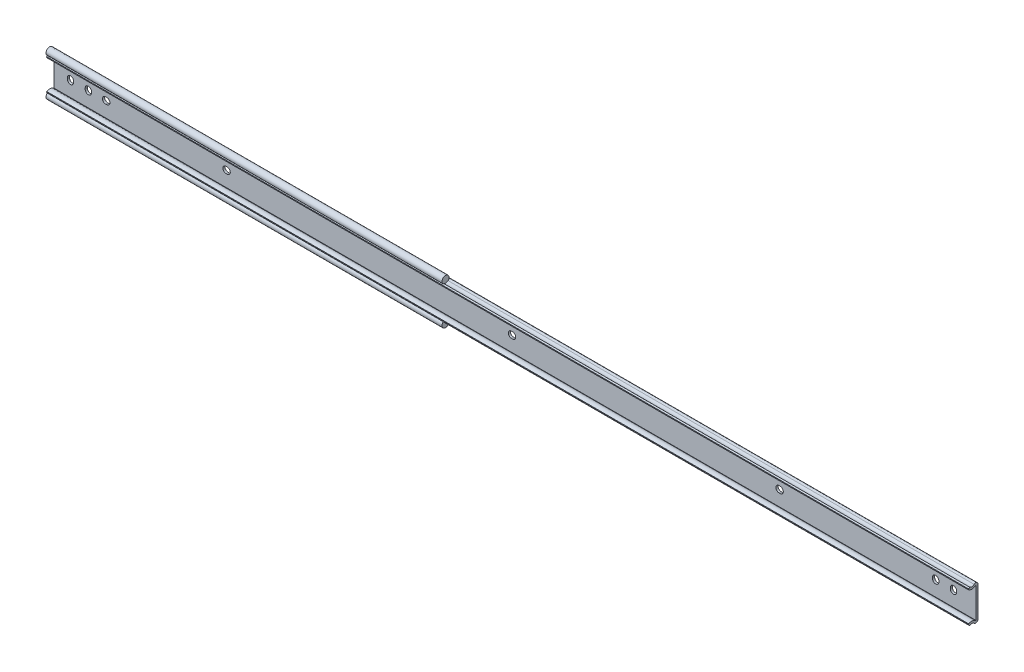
ISO-10303-21;
HEADER;
FILE_DESCRIPTION(('STEP AP214'),'2;1');
FILE_NAME('part.step','',(''),(''),'','','');
FILE_SCHEMA(('AUTOMOTIVE_DESIGN { 1 0 10303 214 1 1 1 1 }'));
ENDSEC;
DATA;
#1=APPLICATION_CONTEXT('core data for automotive mechanical design processes');
#2=APPLICATION_PROTOCOL_DEFINITION('international standard','automotive_design',2000,#1);
#3=PRODUCT_CONTEXT('',#1,'mechanical');
#4=PRODUCT('Part','Part','',(#3));
#5=PRODUCT_RELATED_PRODUCT_CATEGORY('part','',(#4));
#6=PRODUCT_DEFINITION_FORMATION('','',#4);
#7=PRODUCT_DEFINITION_CONTEXT('part definition',#1,'design');
#8=PRODUCT_DEFINITION('design','',#6,#7);
#9=PRODUCT_DEFINITION_SHAPE('','',#8);
#10=(LENGTH_UNIT() NAMED_UNIT(*) SI_UNIT(.MILLI.,.METRE.));
#11=(NAMED_UNIT(*) PLANE_ANGLE_UNIT() SI_UNIT($,.RADIAN.));
#12=(NAMED_UNIT(*) SI_UNIT($,.STERADIAN.) SOLID_ANGLE_UNIT());
#13=UNCERTAINTY_MEASURE_WITH_UNIT(LENGTH_MEASURE(1.E-05),#10,'distance_accuracy_value','');
#14=(GEOMETRIC_REPRESENTATION_CONTEXT(3) GLOBAL_UNCERTAINTY_ASSIGNED_CONTEXT((#13)) GLOBAL_UNIT_ASSIGNED_CONTEXT((#10,
#11,#12)) REPRESENTATION_CONTEXT('',''));
#15=CARTESIAN_POINT('',(0.,0.,0.));
#16=DIRECTION('',(0.,0.,1.));
#17=DIRECTION('',(1.,0.,0.));
#18=AXIS2_PLACEMENT_3D('',#15,#16,#17);
#19=CARTESIAN_POINT('',(-11.9,13.9150000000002,4.44999999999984));
#20=DIRECTION('',(1.,0.,0.));
#21=DIRECTION('',(0.,0.,-1.));
#22=AXIS2_PLACEMENT_3D('',#19,#20,#21);
#23=CYLINDRICAL_SURFACE('',#22,2.55000000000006);
#24=DIRECTION('',(1.,0.,0.));
#25=VECTOR('',#24,1.);
#26=CARTESIAN_POINT('',(-11.9,12.0059666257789,2.75941087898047));
#27=LINE('',#26,#25);
#28=CARTESIAN_POINT('',(270.,12.0059666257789,2.75941087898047));
#29=VERTEX_POINT('',#28);
#30=CARTESIAN_POINT('',(644.5,12.0059666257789,2.75941087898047));
#31=VERTEX_POINT('',#30);
#32=EDGE_CURVE('E604',#29,#31,#27,.T.);
#33=ORIENTED_EDGE('',*,*,#32,.F.);
#34=CARTESIAN_POINT('',(270.,13.9150000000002,4.44999999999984));
#35=DIRECTION('',(-1.,0.,0.));
#36=DIRECTION('',(0.,0.,1.));
#37=AXIS2_PLACEMENT_3D('',#34,#35,#36);
#38=CIRCLE('',#37,2.55000000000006);
#39=CARTESIAN_POINT('',(270.,11.8784795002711,5.98462837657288));
#40=VERTEX_POINT('',#39);
#41=EDGE_CURVE('E357',#29,#40,#38,.T.);
#42=ORIENTED_EDGE('',*,*,#41,.T.);
#43=DIRECTION('',(1.,0.,0.));
#44=VECTOR('',#43,1.);
#45=CARTESIAN_POINT('',(-11.9,11.8784795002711,5.98462837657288));
#46=LINE('',#45,#44);
#47=CARTESIAN_POINT('',(644.5,11.8784795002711,5.98462837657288));
#48=VERTEX_POINT('',#47);
#49=EDGE_CURVE('E603',#40,#48,#46,.T.);
#50=ORIENTED_EDGE('',*,*,#49,.T.);
#51=CARTESIAN_POINT('',(644.5,13.9150000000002,4.44999999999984));
#52=DIRECTION('',(-1.,0.,0.));
#53=DIRECTION('',(0.,0.,1.));
#54=AXIS2_PLACEMENT_3D('',#51,#52,#53);
#55=CIRCLE('',#54,2.55000000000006);
#56=EDGE_CURVE('E531',#31,#48,#55,.T.);
#57=ORIENTED_EDGE('',*,*,#56,.F.);
#58=EDGE_LOOP('',(#33,#42,#50,#57));
#59=FACE_BOUND('',#58,.T.);
#60=ADVANCED_FACE('F14',(#59),#23,.F.);
#61=CARTESIAN_POINT('',(-11.9,-10.7622239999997,0.));
#62=DIRECTION('',(0.,0.,-1.));
#63=DIRECTION('',(-1.,0.,0.));
#64=AXIS2_PLACEMENT_3D('',#61,#62,#63);
#65=PLANE('',#64);
#66=DIRECTION('',(0.,1.,0.));
#67=VECTOR('',#66,1.);
#68=CARTESIAN_POINT('',(-11.9,-10.7622239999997,0.));
#69=LINE('',#68,#67);
#70=CARTESIAN_POINT('',(-11.9,-10.7622239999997,0.));
#71=VERTEX_POINT('',#70);
#72=CARTESIAN_POINT('',(-11.9,10.7622240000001,0.));
#73=VERTEX_POINT('',#72);
#74=EDGE_CURVE('E599',#71,#73,#69,.T.);
#75=ORIENTED_EDGE('',*,*,#74,.T.);
#76=DIRECTION('',(1.,0.,0.));
#77=VECTOR('',#76,1.);
#78=CARTESIAN_POINT('',(-11.9,10.7622240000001,0.));
#79=LINE('',#78,#77);
#80=CARTESIAN_POINT('',(644.5,10.7622240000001,0.));
#81=VERTEX_POINT('',#80);
#82=EDGE_CURVE('E607',#73,#81,#79,.T.);
#83=ORIENTED_EDGE('',*,*,#82,.T.);
#84=DIRECTION('',(0.,1.,0.));
#85=VECTOR('',#84,1.);
#86=CARTESIAN_POINT('',(644.5,-10.7622239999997,0.));
#87=LINE('',#86,#85);
#88=CARTESIAN_POINT('',(644.5,-10.7622239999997,0.));
#89=VERTEX_POINT('',#88);
#90=EDGE_CURVE('E572',#89,#81,#87,.T.);
#91=ORIENTED_EDGE('',*,*,#90,.F.);
#92=DIRECTION('',(1.,0.,0.));
#93=VECTOR('',#92,1.);
#94=CARTESIAN_POINT('',(-11.9,-10.7622239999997,0.));
#95=LINE('',#94,#93);
#96=EDGE_CURVE('E609',#71,#89,#95,.T.);
#97=ORIENTED_EDGE('',*,*,#96,.F.);
#98=EDGE_LOOP('',(#75,#83,#91,#97));
#99=FACE_BOUND('',#98,.T.);
#100=CARTESIAN_POINT('',(504.400000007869,0.00222400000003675,0.));
#101=DIRECTION('',(0.,0.,-1.));
#102=DIRECTION('',(-1.,0.,0.));
#103=AXIS2_PLACEMENT_3D('',#100,#101,#102);
#104=CIRCLE('',#103,2.25);
#105=CARTESIAN_POINT('',(504.400000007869,-2.24777599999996,0.));
#106=VERTEX_POINT('',#105);
#107=CARTESIAN_POINT('',(504.400000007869,2.25222400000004,0.));
#108=VERTEX_POINT('',#107);
#109=EDGE_CURVE('E374',#106,#108,#104,.T.);
#110=ORIENTED_EDGE('',*,*,#109,.F.);
#111=DIRECTION('',(-1.,0.,0.));
#112=VECTOR('',#111,1.);
#113=CARTESIAN_POINT('',(505.200000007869,-2.24777599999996,0.));
#114=LINE('',#113,#112);
#115=CARTESIAN_POINT('',(505.200000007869,-2.24777599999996,0.));
#116=VERTEX_POINT('',#115);
#117=EDGE_CURVE('E382',#116,#106,#114,.T.);
#118=ORIENTED_EDGE('',*,*,#117,.F.);
#119=CARTESIAN_POINT('',(505.200000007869,0.00222400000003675,0.));
#120=DIRECTION('',(0.,0.,-1.));
#121=DIRECTION('',(-1.,0.,0.));
#122=AXIS2_PLACEMENT_3D('',#119,#120,#121);
#123=CIRCLE('',#122,2.25);
#124=CARTESIAN_POINT('',(505.200000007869,2.25222400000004,0.));
#125=VERTEX_POINT('',#124);
#126=EDGE_CURVE('E379',#125,#116,#123,.T.);
#127=ORIENTED_EDGE('',*,*,#126,.F.);
#128=DIRECTION('',(1.,0.,0.));
#129=VECTOR('',#128,1.);
#130=CARTESIAN_POINT('',(504.400000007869,2.25222400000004,0.));
#131=LINE('',#130,#129);
#132=EDGE_CURVE('E376',#108,#125,#131,.T.);
#133=ORIENTED_EDGE('',*,*,#132,.F.);
#134=EDGE_LOOP('',(#110,#118,#127,#133));
#135=FACE_BOUND('',#134,.T.);
#136=CARTESIAN_POINT('',(110.700000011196,0.0034040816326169,0.));
#137=DIRECTION('',(0.,0.,-1.));
#138=DIRECTION('',(-1.,0.,0.));
#139=AXIS2_PLACEMENT_3D('',#136,#137,#138);
#140=CIRCLE('',#139,2.25);
#141=CARTESIAN_POINT('',(110.700000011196,-2.24659591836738,0.));
#142=VERTEX_POINT('',#141);
#143=CARTESIAN_POINT('',(110.700000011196,2.25340408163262,0.));
#144=VERTEX_POINT('',#143);
#145=EDGE_CURVE('E397',#142,#144,#140,.T.);
#146=ORIENTED_EDGE('',*,*,#145,.F.);
#147=DIRECTION('',(-1.,0.,0.));
#148=VECTOR('',#147,1.);
#149=CARTESIAN_POINT('',(111.500000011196,-2.24659591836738,0.));
#150=LINE('',#149,#148);
#151=CARTESIAN_POINT('',(111.500000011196,-2.24659591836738,0.));
#152=VERTEX_POINT('',#151);
#153=EDGE_CURVE('E405',#152,#142,#150,.T.);
#154=ORIENTED_EDGE('',*,*,#153,.F.);
#155=CARTESIAN_POINT('',(111.500000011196,0.0034040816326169,0.));
#156=DIRECTION('',(0.,0.,-1.));
#157=DIRECTION('',(-1.,0.,0.));
#158=AXIS2_PLACEMENT_3D('',#155,#156,#157);
#159=CIRCLE('',#158,2.25);
#160=CARTESIAN_POINT('',(111.500000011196,2.25340408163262,0.));
#161=VERTEX_POINT('',#160);
#162=EDGE_CURVE('E402',#161,#152,#159,.T.);
#163=ORIENTED_EDGE('',*,*,#162,.F.);
#164=DIRECTION('',(1.,0.,0.));
#165=VECTOR('',#164,1.);
#166=CARTESIAN_POINT('',(110.700000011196,2.25340408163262,0.));
#167=LINE('',#166,#165);
#168=EDGE_CURVE('E399',#144,#161,#167,.T.);
#169=ORIENTED_EDGE('',*,*,#168,.F.);
#170=EDGE_LOOP('',(#146,#154,#163,#169));
#171=FACE_BOUND('',#170,.T.);
#172=CARTESIAN_POINT('',(313.900000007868,0.00222400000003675,0.));
#173=DIRECTION('',(0.,0.,-1.));
#174=DIRECTION('',(-1.,0.,0.));
#175=AXIS2_PLACEMENT_3D('',#172,#173,#174);
#176=CIRCLE('',#175,2.25);
#177=CARTESIAN_POINT('',(313.900000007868,-2.24777599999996,0.));
#178=VERTEX_POINT('',#177);
#179=CARTESIAN_POINT('',(313.900000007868,2.25222400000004,0.));
#180=VERTEX_POINT('',#179);
#181=EDGE_CURVE('E411',#178,#180,#176,.T.);
#182=ORIENTED_EDGE('',*,*,#181,.F.);
#183=DIRECTION('',(-1.,0.,0.));
#184=VECTOR('',#183,1.);
#185=CARTESIAN_POINT('',(314.700000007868,-2.24777599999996,0.));
#186=LINE('',#185,#184);
#187=CARTESIAN_POINT('',(314.700000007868,-2.24777599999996,0.));
#188=VERTEX_POINT('',#187);
#189=EDGE_CURVE('E425',#188,#178,#186,.T.);
#190=ORIENTED_EDGE('',*,*,#189,.F.);
#191=CARTESIAN_POINT('',(314.700000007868,0.00222400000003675,0.));
#192=DIRECTION('',(0.,0.,-1.));
#193=DIRECTION('',(-1.,0.,0.));
#194=AXIS2_PLACEMENT_3D('',#191,#192,#193);
#195=CIRCLE('',#194,2.25);
#196=CARTESIAN_POINT('',(314.700000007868,2.25222400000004,0.));
#197=VERTEX_POINT('',#196);
#198=EDGE_CURVE('E422',#197,#188,#195,.T.);
#199=ORIENTED_EDGE('',*,*,#198,.F.);
#200=DIRECTION('',(1.,0.,0.));
#201=VECTOR('',#200,1.);
#202=CARTESIAN_POINT('',(313.900000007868,2.25222400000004,0.));
#203=LINE('',#202,#201);
#204=EDGE_CURVE('E419',#180,#197,#203,.T.);
#205=ORIENTED_EDGE('',*,*,#204,.F.);
#206=EDGE_LOOP('',(#182,#190,#199,#205));
#207=FACE_BOUND('',#206,.T.);
#208=CARTESIAN_POINT('',(25.0000000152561,0.00429010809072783,0.));
#209=DIRECTION('',(0.,0.,-1.));
#210=DIRECTION('',(-1.,0.,0.));
#211=AXIS2_PLACEMENT_3D('',#208,#209,#210);
#212=CIRCLE('',#211,2.25);
#213=CARTESIAN_POINT('',(25.0000000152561,-2.24570989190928,0.));
#214=VERTEX_POINT('',#213);
#215=CARTESIAN_POINT('',(25.0000000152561,2.25429010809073,0.));
#216=VERTEX_POINT('',#215);
#217=EDGE_CURVE('E431',#214,#216,#212,.T.);
#218=ORIENTED_EDGE('',*,*,#217,.F.);
#219=DIRECTION('',(-1.,0.,0.));
#220=VECTOR('',#219,1.);
#221=CARTESIAN_POINT('',(25.800000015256,-2.24570989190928,0.));
#222=LINE('',#221,#220);
#223=CARTESIAN_POINT('',(25.800000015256,-2.24570989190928,0.));
#224=VERTEX_POINT('',#223);
#225=EDGE_CURVE('E445',#224,#214,#222,.T.);
#226=ORIENTED_EDGE('',*,*,#225,.F.);
#227=CARTESIAN_POINT('',(25.800000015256,0.00429010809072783,0.));
#228=DIRECTION('',(0.,0.,-1.));
#229=DIRECTION('',(-1.,0.,0.));
#230=AXIS2_PLACEMENT_3D('',#227,#228,#229);
#231=CIRCLE('',#230,2.25);
#232=CARTESIAN_POINT('',(25.800000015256,2.25429010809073,0.));
#233=VERTEX_POINT('',#232);
#234=EDGE_CURVE('E442',#233,#224,#231,.T.);
#235=ORIENTED_EDGE('',*,*,#234,.F.);
#236=DIRECTION('',(1.,0.,0.));
#237=VECTOR('',#236,1.);
#238=CARTESIAN_POINT('',(25.0000000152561,2.25429010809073,0.));
#239=LINE('',#238,#237);
#240=EDGE_CURVE('E439',#216,#233,#239,.T.);
#241=ORIENTED_EDGE('',*,*,#240,.F.);
#242=EDGE_LOOP('',(#218,#226,#235,#241));
#243=FACE_BOUND('',#242,.T.);
#244=CARTESIAN_POINT('',(0.,-0.400000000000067,0.));
#245=DIRECTION('',(0.,0.,-1.));
#246=DIRECTION('',(1.,0.,0.));
#247=AXIS2_PLACEMENT_3D('',#244,#245,#246);
#248=CIRCLE('',#247,2.24999999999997);
#249=CARTESIAN_POINT('',(2.24999999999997,-0.400000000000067,0.));
#250=VERTEX_POINT('',#249);
#251=CARTESIAN_POINT('',(-2.25000000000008,-0.400000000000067,0.));
#252=VERTEX_POINT('',#251);
#253=EDGE_CURVE('E451',#250,#252,#248,.T.);
#254=ORIENTED_EDGE('',*,*,#253,.F.);
#255=DIRECTION('',(0.,-1.,0.));
#256=VECTOR('',#255,1.);
#257=CARTESIAN_POINT('',(2.24999999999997,-0.400000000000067,0.));
#258=LINE('',#257,#256);
#259=CARTESIAN_POINT('',(2.24999999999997,0.400000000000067,0.));
#260=VERTEX_POINT('',#259);
#261=EDGE_CURVE('E465',#260,#250,#258,.T.);
#262=ORIENTED_EDGE('',*,*,#261,.F.);
#263=CARTESIAN_POINT('',(0.,0.400000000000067,0.));
#264=DIRECTION('',(0.,0.,-1.));
#265=DIRECTION('',(1.,0.,0.));
#266=AXIS2_PLACEMENT_3D('',#263,#264,#265);
#267=CIRCLE('',#266,2.24999999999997);
#268=CARTESIAN_POINT('',(-2.25000000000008,0.400000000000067,0.));
#269=VERTEX_POINT('',#268);
#270=EDGE_CURVE('E462',#269,#260,#267,.T.);
#271=ORIENTED_EDGE('',*,*,#270,.F.);
#272=DIRECTION('',(0.,1.,0.));
#273=VECTOR('',#272,1.);
#274=CARTESIAN_POINT('',(-2.25000000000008,-0.400000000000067,0.));
#275=LINE('',#274,#273);
#276=EDGE_CURVE('E459',#252,#269,#275,.T.);
#277=ORIENTED_EDGE('',*,*,#276,.F.);
#278=EDGE_LOOP('',(#254,#262,#271,#277));
#279=FACE_BOUND('',#278,.T.);
#280=CARTESIAN_POINT('',(12.7,-0.400000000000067,0.));
#281=DIRECTION('',(0.,0.,-1.));
#282=DIRECTION('',(1.,0.,0.));
#283=AXIS2_PLACEMENT_3D('',#280,#281,#282);
#284=CIRCLE('',#283,2.24999999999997);
#285=CARTESIAN_POINT('',(14.95,-0.400000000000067,0.));
#286=VERTEX_POINT('',#285);
#287=CARTESIAN_POINT('',(10.45,-0.400000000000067,0.));
#288=VERTEX_POINT('',#287);
#289=EDGE_CURVE('E471',#286,#288,#284,.T.);
#290=ORIENTED_EDGE('',*,*,#289,.F.);
#291=DIRECTION('',(0.,-1.,0.));
#292=VECTOR('',#291,1.);
#293=CARTESIAN_POINT('',(14.95,-0.400000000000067,0.));
#294=LINE('',#293,#292);
#295=CARTESIAN_POINT('',(14.95,0.400000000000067,0.));
#296=VERTEX_POINT('',#295);
#297=EDGE_CURVE('E485',#296,#286,#294,.T.);
#298=ORIENTED_EDGE('',*,*,#297,.F.);
#299=CARTESIAN_POINT('',(12.7,0.400000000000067,0.));
#300=DIRECTION('',(0.,0.,-1.));
#301=DIRECTION('',(1.,0.,0.));
#302=AXIS2_PLACEMENT_3D('',#299,#300,#301);
#303=CIRCLE('',#302,2.24999999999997);
#304=CARTESIAN_POINT('',(10.45,0.400000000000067,0.));
#305=VERTEX_POINT('',#304);
#306=EDGE_CURVE('E482',#305,#296,#303,.T.);
#307=ORIENTED_EDGE('',*,*,#306,.F.);
#308=DIRECTION('',(0.,1.,0.));
#309=VECTOR('',#308,1.);
#310=CARTESIAN_POINT('',(10.45,-0.400000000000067,0.));
#311=LINE('',#310,#309);
#312=EDGE_CURVE('E479',#288,#305,#311,.T.);
#313=ORIENTED_EDGE('',*,*,#312,.F.);
#314=EDGE_LOOP('',(#290,#298,#307,#313));
#315=FACE_BOUND('',#314,.T.);
#316=CARTESIAN_POINT('',(615.9,-0.400000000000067,0.));
#317=DIRECTION('',(0.,0.,-1.));
#318=DIRECTION('',(1.,0.,0.));
#319=AXIS2_PLACEMENT_3D('',#316,#317,#318);
#320=CIRCLE('',#319,2.24999999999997);
#321=CARTESIAN_POINT('',(618.15,-0.400000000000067,0.));
#322=VERTEX_POINT('',#321);
#323=CARTESIAN_POINT('',(613.65,-0.400000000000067,0.));
#324=VERTEX_POINT('',#323);
#325=EDGE_CURVE('E491',#322,#324,#320,.T.);
#326=ORIENTED_EDGE('',*,*,#325,.F.);
#327=DIRECTION('',(0.,-1.,0.));
#328=VECTOR('',#327,1.);
#329=CARTESIAN_POINT('',(618.15,-0.400000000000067,0.));
#330=LINE('',#329,#328);
#331=CARTESIAN_POINT('',(618.15,0.400000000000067,0.));
#332=VERTEX_POINT('',#331);
#333=EDGE_CURVE('E505',#332,#322,#330,.T.);
#334=ORIENTED_EDGE('',*,*,#333,.F.);
#335=CARTESIAN_POINT('',(615.9,0.400000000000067,0.));
#336=DIRECTION('',(0.,0.,-1.));
#337=DIRECTION('',(1.,0.,0.));
#338=AXIS2_PLACEMENT_3D('',#335,#336,#337);
#339=CIRCLE('',#338,2.24999999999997);
#340=CARTESIAN_POINT('',(613.65,0.400000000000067,0.));
#341=VERTEX_POINT('',#340);
#342=EDGE_CURVE('E502',#341,#332,#339,.T.);
#343=ORIENTED_EDGE('',*,*,#342,.F.);
#344=DIRECTION('',(0.,1.,0.));
#345=VECTOR('',#344,1.);
#346=CARTESIAN_POINT('',(613.65,-0.400000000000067,0.));
#347=LINE('',#346,#345);
#348=EDGE_CURVE('E499',#324,#341,#347,.T.);
#349=ORIENTED_EDGE('',*,*,#348,.F.);
#350=EDGE_LOOP('',(#326,#334,#343,#349));
#351=FACE_BOUND('',#350,.T.);
#352=CARTESIAN_POINT('',(628.6,-0.400000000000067,0.));
#353=DIRECTION('',(0.,0.,-1.));
#354=DIRECTION('',(1.,0.,0.));
#355=AXIS2_PLACEMENT_3D('',#352,#353,#354);
#356=CIRCLE('',#355,2.24999999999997);
#357=CARTESIAN_POINT('',(630.85,-0.400000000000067,0.));
#358=VERTEX_POINT('',#357);
#359=CARTESIAN_POINT('',(626.35,-0.400000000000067,0.));
#360=VERTEX_POINT('',#359);
#361=EDGE_CURVE('E511',#358,#360,#356,.T.);
#362=ORIENTED_EDGE('',*,*,#361,.F.);
#363=DIRECTION('',(0.,-1.,0.));
#364=VECTOR('',#363,1.);
#365=CARTESIAN_POINT('',(630.85,-0.400000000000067,0.));
#366=LINE('',#365,#364);
#367=CARTESIAN_POINT('',(630.85,0.400000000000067,0.));
#368=VERTEX_POINT('',#367);
#369=EDGE_CURVE('E525',#368,#358,#366,.T.);
#370=ORIENTED_EDGE('',*,*,#369,.F.);
#371=CARTESIAN_POINT('',(628.6,0.400000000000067,0.));
#372=DIRECTION('',(0.,0.,-1.));
#373=DIRECTION('',(1.,0.,0.));
#374=AXIS2_PLACEMENT_3D('',#371,#372,#373);
#375=CIRCLE('',#374,2.24999999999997);
#376=CARTESIAN_POINT('',(626.35,0.400000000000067,0.));
#377=VERTEX_POINT('',#376);
#378=EDGE_CURVE('E522',#377,#368,#375,.T.);
#379=ORIENTED_EDGE('',*,*,#378,.F.);
#380=DIRECTION('',(0.,1.,0.));
#381=VECTOR('',#380,1.);
#382=CARTESIAN_POINT('',(626.35,-0.400000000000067,0.));
#383=LINE('',#382,#381);
#384=EDGE_CURVE('E519',#360,#377,#383,.T.);
#385=ORIENTED_EDGE('',*,*,#384,.F.);
#386=EDGE_LOOP('',(#362,#370,#379,#385));
#387=FACE_BOUND('',#386,.T.);
#388=ADVANCED_FACE('F722',(#99,#135,#171,#207,#243,#279,#315,#351,#387),#65,.T.);
#389=CARTESIAN_POINT('',(-11.9,10.7622240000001,1.54999999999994));
#390=DIRECTION('',(0.,0.,1.));
#391=DIRECTION('',(1.,0.,0.));
#392=AXIS2_PLACEMENT_3D('',#389,#390,#391);
#393=PLANE('',#392);
#394=DIRECTION('',(0.,-1.,0.));
#395=VECTOR('',#394,1.);
#396=CARTESIAN_POINT('',(-11.9,10.7622240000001,1.54999999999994));
#397=LINE('',#396,#395);
#398=CARTESIAN_POINT('',(-11.9,10.7622240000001,1.54999999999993));
#399=VERTEX_POINT('',#398);
#400=CARTESIAN_POINT('',(-11.9,-10.7622239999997,1.54999999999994));
#401=VERTEX_POINT('',#400);
#402=EDGE_CURVE('E584',#399,#401,#397,.T.);
#403=ORIENTED_EDGE('',*,*,#402,.T.);
#404=DIRECTION('',(1.,0.,0.));
#405=VECTOR('',#404,1.);
#406=CARTESIAN_POINT('',(-11.9,-10.7622239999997,1.54999999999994));
#407=LINE('',#406,#405);
#408=CARTESIAN_POINT('',(644.5,-10.7622239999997,1.54999999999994));
#409=VERTEX_POINT('',#408);
#410=EDGE_CURVE('E622',#401,#409,#407,.T.);
#411=ORIENTED_EDGE('',*,*,#410,.T.);
#412=DIRECTION('',(0.,-1.,0.));
#413=VECTOR('',#412,1.);
#414=CARTESIAN_POINT('',(644.5,10.7622240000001,1.54999999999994));
#415=LINE('',#414,#413);
#416=CARTESIAN_POINT('',(644.5,10.7622240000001,1.54999999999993));
#417=VERTEX_POINT('',#416);
#418=EDGE_CURVE('E552',#417,#409,#415,.T.);
#419=ORIENTED_EDGE('',*,*,#418,.F.);
#420=DIRECTION('',(1.,0.,0.));
#421=VECTOR('',#420,1.);
#422=CARTESIAN_POINT('',(-11.9,10.7622240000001,1.54999999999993));
#423=LINE('',#422,#421);
#424=EDGE_CURVE('E624',#399,#417,#423,.T.);
#425=ORIENTED_EDGE('',*,*,#424,.F.);
#426=EDGE_LOOP('',(#403,#411,#419,#425));
#427=FACE_BOUND('',#426,.T.);
#428=CARTESIAN_POINT('',(504.400000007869,0.00222400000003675,1.54999999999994));
#429=DIRECTION('',(0.,0.,1.));
#430=DIRECTION('',(1.,0.,0.));
#431=AXIS2_PLACEMENT_3D('',#428,#429,#430);
#432=CIRCLE('',#431,2.25);
#433=CARTESIAN_POINT('',(504.400000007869,-2.24777599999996,1.54999999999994));
#434=VERTEX_POINT('',#433);
#435=CARTESIAN_POINT('',(504.400000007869,2.25222400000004,1.54999999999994));
#436=VERTEX_POINT('',#435);
#437=EDGE_CURVE('E371',#434,#436,#432,.F.);
#438=ORIENTED_EDGE('',*,*,#437,.T.);
#439=DIRECTION('',(1.,0.,0.));
#440=VECTOR('',#439,1.);
#441=CARTESIAN_POINT('',(504.400000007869,2.25222400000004,1.54999999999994));
#442=LINE('',#441,#440);
#443=CARTESIAN_POINT('',(505.200000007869,2.25222400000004,1.54999999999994));
#444=VERTEX_POINT('',#443);
#445=EDGE_CURVE('E388',#436,#444,#442,.T.);
#446=ORIENTED_EDGE('',*,*,#445,.T.);
#447=CARTESIAN_POINT('',(505.200000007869,0.00222400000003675,1.54999999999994));
#448=DIRECTION('',(0.,0.,1.));
#449=DIRECTION('',(1.,0.,0.));
#450=AXIS2_PLACEMENT_3D('',#447,#448,#449);
#451=CIRCLE('',#450,2.25);
#452=CARTESIAN_POINT('',(505.200000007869,-2.24777599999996,1.54999999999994));
#453=VERTEX_POINT('',#452);
#454=EDGE_CURVE('E365',#444,#453,#451,.F.);
#455=ORIENTED_EDGE('',*,*,#454,.T.);
#456=DIRECTION('',(-1.,0.,0.));
#457=VECTOR('',#456,1.);
#458=CARTESIAN_POINT('',(505.200000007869,-2.24777599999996,1.54999999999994));
#459=LINE('',#458,#457);
#460=EDGE_CURVE('E368',#453,#434,#459,.T.);
#461=ORIENTED_EDGE('',*,*,#460,.T.);
#462=EDGE_LOOP('',(#438,#446,#455,#461));
#463=FACE_BOUND('',#462,.T.);
#464=CARTESIAN_POINT('',(110.700000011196,0.0034040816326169,1.54999999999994));
#465=DIRECTION('',(0.,0.,1.));
#466=DIRECTION('',(1.,0.,0.));
#467=AXIS2_PLACEMENT_3D('',#464,#465,#466);
#468=CIRCLE('',#467,2.25);
#469=CARTESIAN_POINT('',(110.700000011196,2.25340408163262,1.54999999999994));
#470=VERTEX_POINT('',#469);
#471=CARTESIAN_POINT('',(110.700000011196,-2.24659591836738,1.54999999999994));
#472=VERTEX_POINT('',#471);
#473=EDGE_CURVE('E693',#470,#472,#468,.T.);
#474=ORIENTED_EDGE('',*,*,#473,.F.);
#475=DIRECTION('',(-1.,0.,0.));
#476=VECTOR('',#475,1.);
#477=CARTESIAN_POINT('',(-11.9,2.25340408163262,1.54999999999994));
#478=LINE('',#477,#476);
#479=CARTESIAN_POINT('',(111.500000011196,2.25340408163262,1.54999999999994));
#480=VERTEX_POINT('',#479);
#481=EDGE_CURVE('E686',#480,#470,#478,.T.);
#482=ORIENTED_EDGE('',*,*,#481,.F.);
#483=CARTESIAN_POINT('',(111.500000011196,0.0034040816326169,1.54999999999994));
#484=DIRECTION('',(0.,0.,1.));
#485=DIRECTION('',(1.,0.,0.));
#486=AXIS2_PLACEMENT_3D('',#483,#484,#485);
#487=CIRCLE('',#486,2.25);
#488=CARTESIAN_POINT('',(111.500000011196,-2.24659591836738,1.54999999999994));
#489=VERTEX_POINT('',#488);
#490=EDGE_CURVE('E688',#489,#480,#487,.T.);
#491=ORIENTED_EDGE('',*,*,#490,.F.);
#492=DIRECTION('',(1.,0.,0.));
#493=VECTOR('',#492,1.);
#494=CARTESIAN_POINT('',(-11.9,-2.24659591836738,1.54999999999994));
#495=LINE('',#494,#493);
#496=EDGE_CURVE('E691',#472,#489,#495,.T.);
#497=ORIENTED_EDGE('',*,*,#496,.F.);
#498=EDGE_LOOP('',(#474,#482,#491,#497));
#499=FACE_BOUND('',#498,.T.);
#500=CARTESIAN_POINT('',(313.900000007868,0.00222400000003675,1.54999999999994));
#501=DIRECTION('',(0.,0.,1.));
#502=DIRECTION('',(1.,0.,0.));
#503=AXIS2_PLACEMENT_3D('',#500,#501,#502);
#504=CIRCLE('',#503,2.25);
#505=CARTESIAN_POINT('',(313.900000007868,2.25222400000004,1.54999999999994));
#506=VERTEX_POINT('',#505);
#507=CARTESIAN_POINT('',(313.900000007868,-2.24777599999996,1.54999999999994));
#508=VERTEX_POINT('',#507);
#509=EDGE_CURVE('E684',#506,#508,#504,.T.);
#510=ORIENTED_EDGE('',*,*,#509,.F.);
#511=DIRECTION('',(-1.,0.,0.));
#512=VECTOR('',#511,1.);
#513=CARTESIAN_POINT('',(-11.9,2.25222400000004,1.54999999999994));
#514=LINE('',#513,#512);
#515=CARTESIAN_POINT('',(314.700000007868,2.25222400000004,1.54999999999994));
#516=VERTEX_POINT('',#515);
#517=EDGE_CURVE('E677',#516,#506,#514,.T.);
#518=ORIENTED_EDGE('',*,*,#517,.F.);
#519=CARTESIAN_POINT('',(314.700000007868,0.00222400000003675,1.54999999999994));
#520=DIRECTION('',(0.,0.,1.));
#521=DIRECTION('',(1.,0.,0.));
#522=AXIS2_PLACEMENT_3D('',#519,#520,#521);
#523=CIRCLE('',#522,2.25);
#524=CARTESIAN_POINT('',(314.700000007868,-2.24777599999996,1.54999999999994));
#525=VERTEX_POINT('',#524);
#526=EDGE_CURVE('E679',#525,#516,#523,.T.);
#527=ORIENTED_EDGE('',*,*,#526,.F.);
#528=DIRECTION('',(1.,0.,0.));
#529=VECTOR('',#528,1.);
#530=CARTESIAN_POINT('',(-11.9,-2.24777599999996,1.54999999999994));
#531=LINE('',#530,#529);
#532=EDGE_CURVE('E682',#508,#525,#531,.T.);
#533=ORIENTED_EDGE('',*,*,#532,.F.);
#534=EDGE_LOOP('',(#510,#518,#527,#533));
#535=FACE_BOUND('',#534,.T.);
#536=CARTESIAN_POINT('',(25.0000000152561,0.00429010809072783,1.54999999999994));
#537=DIRECTION('',(0.,0.,1.));
#538=DIRECTION('',(1.,0.,0.));
#539=AXIS2_PLACEMENT_3D('',#536,#537,#538);
#540=CIRCLE('',#539,2.25);
#541=CARTESIAN_POINT('',(25.0000000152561,2.25429010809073,1.54999999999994));
#542=VERTEX_POINT('',#541);
#543=CARTESIAN_POINT('',(25.0000000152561,-2.24570989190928,1.54999999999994));
#544=VERTEX_POINT('',#543);
#545=EDGE_CURVE('E675',#542,#544,#540,.T.);
#546=ORIENTED_EDGE('',*,*,#545,.F.);
#547=DIRECTION('',(-1.,0.,0.));
#548=VECTOR('',#547,1.);
#549=CARTESIAN_POINT('',(-11.9,2.25429010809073,1.54999999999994));
#550=LINE('',#549,#548);
#551=CARTESIAN_POINT('',(25.800000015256,2.25429010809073,1.54999999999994));
#552=VERTEX_POINT('',#551);
#553=EDGE_CURVE('E668',#552,#542,#550,.T.);
#554=ORIENTED_EDGE('',*,*,#553,.F.);
#555=CARTESIAN_POINT('',(25.800000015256,0.00429010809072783,1.54999999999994));
#556=DIRECTION('',(0.,0.,1.));
#557=DIRECTION('',(1.,0.,0.));
#558=AXIS2_PLACEMENT_3D('',#555,#556,#557);
#559=CIRCLE('',#558,2.25);
#560=CARTESIAN_POINT('',(25.800000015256,-2.24570989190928,1.54999999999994));
#561=VERTEX_POINT('',#560);
#562=EDGE_CURVE('E670',#561,#552,#559,.T.);
#563=ORIENTED_EDGE('',*,*,#562,.F.);
#564=DIRECTION('',(1.,0.,0.));
#565=VECTOR('',#564,1.);
#566=CARTESIAN_POINT('',(-11.9,-2.24570989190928,1.54999999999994));
#567=LINE('',#566,#565);
#568=EDGE_CURVE('E673',#544,#561,#567,.T.);
#569=ORIENTED_EDGE('',*,*,#568,.F.);
#570=EDGE_LOOP('',(#546,#554,#563,#569));
#571=FACE_BOUND('',#570,.T.);
#572=CARTESIAN_POINT('',(0.,-0.400000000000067,1.54999999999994));
#573=DIRECTION('',(0.,0.,1.));
#574=DIRECTION('',(1.,0.,0.));
#575=AXIS2_PLACEMENT_3D('',#572,#573,#574);
#576=CIRCLE('',#575,2.24999999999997);
#577=CARTESIAN_POINT('',(-2.25000000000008,-0.400000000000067,1.54999999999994));
#578=VERTEX_POINT('',#577);
#579=CARTESIAN_POINT('',(2.24999999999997,-0.400000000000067,1.54999999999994));
#580=VERTEX_POINT('',#579);
#581=EDGE_CURVE('E666',#578,#580,#576,.T.);
#582=ORIENTED_EDGE('',*,*,#581,.F.);
#583=DIRECTION('',(0.,-1.,0.));
#584=VECTOR('',#583,1.);
#585=CARTESIAN_POINT('',(-2.25000000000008,10.7622240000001,1.54999999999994));
#586=LINE('',#585,#584);
#587=CARTESIAN_POINT('',(-2.25000000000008,0.400000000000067,1.54999999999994));
#588=VERTEX_POINT('',#587);
#589=EDGE_CURVE('E659',#588,#578,#586,.T.);
#590=ORIENTED_EDGE('',*,*,#589,.F.);
#591=CARTESIAN_POINT('',(0.,0.400000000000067,1.54999999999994));
#592=DIRECTION('',(0.,0.,1.));
#593=DIRECTION('',(1.,0.,0.));
#594=AXIS2_PLACEMENT_3D('',#591,#592,#593);
#595=CIRCLE('',#594,2.24999999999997);
#596=CARTESIAN_POINT('',(2.24999999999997,0.400000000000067,1.54999999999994));
#597=VERTEX_POINT('',#596);
#598=EDGE_CURVE('E661',#597,#588,#595,.T.);
#599=ORIENTED_EDGE('',*,*,#598,.F.);
#600=DIRECTION('',(0.,1.,0.));
#601=VECTOR('',#600,1.);
#602=CARTESIAN_POINT('',(2.24999999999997,10.7622240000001,1.54999999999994));
#603=LINE('',#602,#601);
#604=EDGE_CURVE('E664',#580,#597,#603,.T.);
#605=ORIENTED_EDGE('',*,*,#604,.F.);
#606=EDGE_LOOP('',(#582,#590,#599,#605));
#607=FACE_BOUND('',#606,.T.);
#608=CARTESIAN_POINT('',(12.7,-0.400000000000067,1.54999999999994));
#609=DIRECTION('',(0.,0.,1.));
#610=DIRECTION('',(1.,0.,0.));
#611=AXIS2_PLACEMENT_3D('',#608,#609,#610);
#612=CIRCLE('',#611,2.24999999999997);
#613=CARTESIAN_POINT('',(10.45,-0.400000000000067,1.54999999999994));
#614=VERTEX_POINT('',#613);
#615=CARTESIAN_POINT('',(14.95,-0.400000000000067,1.54999999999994));
#616=VERTEX_POINT('',#615);
#617=EDGE_CURVE('E657',#614,#616,#612,.T.);
#618=ORIENTED_EDGE('',*,*,#617,.F.);
#619=DIRECTION('',(0.,-1.,0.));
#620=VECTOR('',#619,1.);
#621=CARTESIAN_POINT('',(10.45,10.7622240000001,1.54999999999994));
#622=LINE('',#621,#620);
#623=CARTESIAN_POINT('',(10.45,0.400000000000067,1.54999999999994));
#624=VERTEX_POINT('',#623);
#625=EDGE_CURVE('E650',#624,#614,#622,.T.);
#626=ORIENTED_EDGE('',*,*,#625,.F.);
#627=CARTESIAN_POINT('',(12.7,0.400000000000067,1.54999999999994));
#628=DIRECTION('',(0.,0.,1.));
#629=DIRECTION('',(1.,0.,0.));
#630=AXIS2_PLACEMENT_3D('',#627,#628,#629);
#631=CIRCLE('',#630,2.24999999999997);
#632=CARTESIAN_POINT('',(14.95,0.400000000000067,1.54999999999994));
#633=VERTEX_POINT('',#632);
#634=EDGE_CURVE('E652',#633,#624,#631,.T.);
#635=ORIENTED_EDGE('',*,*,#634,.F.);
#636=DIRECTION('',(0.,1.,0.));
#637=VECTOR('',#636,1.);
#638=CARTESIAN_POINT('',(14.95,10.7622240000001,1.54999999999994));
#639=LINE('',#638,#637);
#640=EDGE_CURVE('E655',#616,#633,#639,.T.);
#641=ORIENTED_EDGE('',*,*,#640,.F.);
#642=EDGE_LOOP('',(#618,#626,#635,#641));
#643=FACE_BOUND('',#642,.T.);
#644=CARTESIAN_POINT('',(615.9,-0.400000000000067,1.54999999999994));
#645=DIRECTION('',(0.,0.,1.));
#646=DIRECTION('',(1.,0.,0.));
#647=AXIS2_PLACEMENT_3D('',#644,#645,#646);
#648=CIRCLE('',#647,2.24999999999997);
#649=CARTESIAN_POINT('',(613.65,-0.400000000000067,1.54999999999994));
#650=VERTEX_POINT('',#649);
#651=CARTESIAN_POINT('',(618.15,-0.400000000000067,1.54999999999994));
#652=VERTEX_POINT('',#651);
#653=EDGE_CURVE('E648',#650,#652,#648,.T.);
#654=ORIENTED_EDGE('',*,*,#653,.F.);
#655=DIRECTION('',(0.,-1.,0.));
#656=VECTOR('',#655,1.);
#657=CARTESIAN_POINT('',(613.65,10.7622240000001,1.54999999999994));
#658=LINE('',#657,#656);
#659=CARTESIAN_POINT('',(613.65,0.400000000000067,1.54999999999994));
#660=VERTEX_POINT('',#659);
#661=EDGE_CURVE('E641',#660,#650,#658,.T.);
#662=ORIENTED_EDGE('',*,*,#661,.F.);
#663=CARTESIAN_POINT('',(615.9,0.400000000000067,1.54999999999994));
#664=DIRECTION('',(0.,0.,1.));
#665=DIRECTION('',(1.,0.,0.));
#666=AXIS2_PLACEMENT_3D('',#663,#664,#665);
#667=CIRCLE('',#666,2.24999999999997);
#668=CARTESIAN_POINT('',(618.15,0.400000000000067,1.54999999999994));
#669=VERTEX_POINT('',#668);
#670=EDGE_CURVE('E643',#669,#660,#667,.T.);
#671=ORIENTED_EDGE('',*,*,#670,.F.);
#672=DIRECTION('',(0.,1.,0.));
#673=VECTOR('',#672,1.);
#674=CARTESIAN_POINT('',(618.15,10.7622240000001,1.54999999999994));
#675=LINE('',#674,#673);
#676=EDGE_CURVE('E646',#652,#669,#675,.T.);
#677=ORIENTED_EDGE('',*,*,#676,.F.);
#678=EDGE_LOOP('',(#654,#662,#671,#677));
#679=FACE_BOUND('',#678,.T.);
#680=CARTESIAN_POINT('',(628.6,-0.400000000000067,1.54999999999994));
#681=DIRECTION('',(0.,0.,1.));
#682=DIRECTION('',(1.,0.,0.));
#683=AXIS2_PLACEMENT_3D('',#680,#681,#682);
#684=CIRCLE('',#683,2.24999999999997);
#685=CARTESIAN_POINT('',(626.35,-0.400000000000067,1.54999999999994));
#686=VERTEX_POINT('',#685);
#687=CARTESIAN_POINT('',(630.85,-0.400000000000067,1.54999999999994));
#688=VERTEX_POINT('',#687);
#689=EDGE_CURVE('E639',#686,#688,#684,.T.);
#690=ORIENTED_EDGE('',*,*,#689,.F.);
#691=DIRECTION('',(0.,-1.,0.));
#692=VECTOR('',#691,1.);
#693=CARTESIAN_POINT('',(626.35,10.7622240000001,1.54999999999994));
#694=LINE('',#693,#692);
#695=CARTESIAN_POINT('',(626.35,0.400000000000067,1.54999999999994));
#696=VERTEX_POINT('',#695);
#697=EDGE_CURVE('E606',#696,#686,#694,.T.);
#698=ORIENTED_EDGE('',*,*,#697,.F.);
#699=CARTESIAN_POINT('',(628.6,0.400000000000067,1.54999999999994));
#700=DIRECTION('',(0.,0.,1.));
#701=DIRECTION('',(1.,0.,0.));
#702=AXIS2_PLACEMENT_3D('',#699,#700,#701);
#703=CIRCLE('',#702,2.24999999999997);
#704=CARTESIAN_POINT('',(630.85,0.400000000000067,1.54999999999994));
#705=VERTEX_POINT('',#704);
#706=EDGE_CURVE('E634',#705,#696,#703,.T.);
#707=ORIENTED_EDGE('',*,*,#706,.F.);
#708=DIRECTION('',(0.,1.,0.));
#709=VECTOR('',#708,1.);
#710=CARTESIAN_POINT('',(630.85,10.7622240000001,1.54999999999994));
#711=LINE('',#710,#709);
#712=EDGE_CURVE('E637',#688,#705,#711,.T.);
#713=ORIENTED_EDGE('',*,*,#712,.F.);
#714=EDGE_LOOP('',(#690,#698,#707,#713));
#715=FACE_BOUND('',#714,.T.);
#716=ADVANCED_FACE('F753',(#427,#463,#499,#535,#571,#607,#643,#679,#715),#393,.T.);
#717=CARTESIAN_POINT('',(-11.9,13.9150000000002,4.44999999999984));
#718=DIRECTION('',(-1.,0.,0.));
#719=DIRECTION('',(0.,0.,1.));
#720=AXIS2_PLACEMENT_3D('',#717,#718,#719);
#721=PLANE('',#720);
#722=CARTESIAN_POINT('',(-11.9,-10.7622239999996,1.66));
#723=DIRECTION('',(1.,0.,0.));
#724=DIRECTION('',(0.,0.,1.));
#725=AXIS2_PLACEMENT_3D('',#722,#723,#724);
#726=CIRCLE('',#725,1.66);
#727=CARTESIAN_POINT('',(-11.9,-12.2669175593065,2.36106867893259));
#728=VERTEX_POINT('',#727);
#729=EDGE_CURVE('E597',#728,#71,#726,.T.);
#730=ORIENTED_EDGE('',*,*,#729,.F.);
#731=CARTESIAN_POINT('',(-11.9,-13.5749999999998,4.55));
#732=DIRECTION('',(-1.,0.,0.));
#733=DIRECTION('',(0.,0.,-1.));
#734=AXIS2_PLACEMENT_3D('',#731,#732,#733);
#735=CIRCLE('',#734,2.55);
#736=CARTESIAN_POINT('',(-11.9,-11.6159967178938,6.18242339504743));
#737=VERTEX_POINT('',#736);
#738=EDGE_CURVE('E709',#728,#737,#735,.T.);
#739=ORIENTED_EDGE('',*,*,#738,.T.);
#740=DIRECTION('',(0.,-0.798635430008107,-0.60181512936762));
#741=VECTOR('',#740,1.);
#742=CARTESIAN_POINT('',(-11.9,-11.8784795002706,5.98462837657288));
#743=LINE('',#742,#741);
#744=CARTESIAN_POINT('',(-11.9,-11.0618539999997,6.6));
#745=VERTEX_POINT('',#744);
#746=EDGE_CURVE('E595',#745,#737,#743,.T.);
#747=ORIENTED_EDGE('',*,*,#746,.F.);
#748=DIRECTION('',(0.,-1.,0.));
#749=VECTOR('',#748,1.);
#750=CARTESIAN_POINT('',(-11.9,-11.0618539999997,6.6));
#751=LINE('',#750,#749);
#752=CARTESIAN_POINT('',(-11.9,-10.4239399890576,6.59999999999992));
#753=VERTEX_POINT('',#752);
#754=EDGE_CURVE('E592',#753,#745,#751,.T.);
#755=ORIENTED_EDGE('',*,*,#754,.F.);
#756=CARTESIAN_POINT('',(-11.9,-13.9149999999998,4.44999999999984));
#757=DIRECTION('',(1.,0.,0.));
#758=DIRECTION('',(0.,0.,1.));
#759=AXIS2_PLACEMENT_3D('',#756,#757,#758);
#760=CIRCLE('',#759,4.1);
#761=CARTESIAN_POINT('',(-11.9,-10.8444026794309,1.73312089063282));
#762=VERTEX_POINT('',#761);
#763=EDGE_CURVE('E589',#762,#753,#760,.T.);
#764=ORIENTED_EDGE('',*,*,#763,.F.);
#765=CARTESIAN_POINT('',(-11.9,-10.7622239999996,1.66));
#766=DIRECTION('',(-1.,0.,0.));
#767=DIRECTION('',(0.,0.,-1.));
#768=AXIS2_PLACEMENT_3D('',#765,#766,#767);
#769=CIRCLE('',#768,0.110000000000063);
#770=EDGE_CURVE('E586',#401,#762,#769,.T.);
#771=ORIENTED_EDGE('',*,*,#770,.F.);
#772=ORIENTED_EDGE('',*,*,#402,.F.);
#773=CARTESIAN_POINT('',(-11.9,10.762224,1.66));
#774=DIRECTION('',(-1.,0.,0.));
#775=DIRECTION('',(0.,0.,1.));
#776=AXIS2_PLACEMENT_3D('',#773,#774,#775);
#777=CIRCLE('',#776,0.110000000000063);
#778=CARTESIAN_POINT('',(-11.9,10.8444026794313,1.73312089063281));
#779=VERTEX_POINT('',#778);
#780=EDGE_CURVE('E581',#779,#399,#777,.T.);
#781=ORIENTED_EDGE('',*,*,#780,.F.);
#782=CARTESIAN_POINT('',(-11.9,13.9150000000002,4.44999999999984));
#783=DIRECTION('',(1.,0.,0.));
#784=DIRECTION('',(0.,0.,-1.));
#785=AXIS2_PLACEMENT_3D('',#782,#783,#784);
#786=CIRCLE('',#785,4.1);
#787=CARTESIAN_POINT('',(-11.9,10.423939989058,6.6));
#788=VERTEX_POINT('',#787);
#789=EDGE_CURVE('E578',#788,#779,#786,.T.);
#790=ORIENTED_EDGE('',*,*,#789,.F.);
#791=DIRECTION('',(0.,-1.,0.));
#792=VECTOR('',#791,1.);
#793=CARTESIAN_POINT('',(-11.9,11.0618540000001,6.6));
#794=LINE('',#793,#792);
#795=CARTESIAN_POINT('',(-11.9,11.0618540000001,6.6));
#796=VERTEX_POINT('',#795);
#797=EDGE_CURVE('E337',#796,#788,#794,.T.);
#798=ORIENTED_EDGE('',*,*,#797,.F.);
#799=DIRECTION('',(0.,-0.798635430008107,0.60181512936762));
#800=VECTOR('',#799,1.);
#801=CARTESIAN_POINT('',(-11.9,11.8784795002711,5.98462837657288));
#802=LINE('',#801,#800);
#803=CARTESIAN_POINT('',(-11.9,11.6159967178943,6.18242339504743));
#804=VERTEX_POINT('',#803);
#805=EDGE_CURVE('E329',#804,#796,#802,.T.);
#806=ORIENTED_EDGE('',*,*,#805,.F.);
#807=CARTESIAN_POINT('',(-11.9,13.5750000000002,4.55));
#808=DIRECTION('',(-1.,0.,0.));
#809=DIRECTION('',(0.,0.,1.));
#810=AXIS2_PLACEMENT_3D('',#807,#808,#809);
#811=CIRCLE('',#810,2.55);
#812=CARTESIAN_POINT('',(-11.9,12.266917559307,2.36106867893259));
#813=VERTEX_POINT('',#812);
#814=EDGE_CURVE('E334',#804,#813,#811,.T.);
#815=ORIENTED_EDGE('',*,*,#814,.T.);
#816=CARTESIAN_POINT('',(-11.9,10.762224,1.66));
#817=DIRECTION('',(1.,0.,0.));
#818=DIRECTION('',(0.,0.,-1.));
#819=AXIS2_PLACEMENT_3D('',#816,#817,#818);
#820=CIRCLE('',#819,1.66);
#821=EDGE_CURVE('E601',#73,#813,#820,.T.);
#822=ORIENTED_EDGE('',*,*,#821,.F.);
#823=ORIENTED_EDGE('',*,*,#74,.F.);
#824=EDGE_LOOP('',(#730,#739,#747,#755,#764,#771,#772,#781,#790,#798,#806,#815,#822,#823));
#825=FACE_BOUND('',#824,.T.);
#826=ADVANCED_FACE('F331',(#825),#721,.T.);
#827=CARTESIAN_POINT('',(-11.9,10.762224,1.66));
#828=DIRECTION('',(1.,0.,0.));
#829=DIRECTION('',(0.,0.,-1.));
#830=AXIS2_PLACEMENT_3D('',#827,#828,#829);
#831=CYLINDRICAL_SURFACE('',#830,1.66);
#832=DIRECTION('',(-1.,0.,0.));
#833=VECTOR('',#832,1.);
#834=CARTESIAN_POINT('',(129.05,12.266917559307,2.36106867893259));
#835=LINE('',#834,#833);
#836=CARTESIAN_POINT('',(270.,12.266917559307,2.36106867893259));
#837=VERTEX_POINT('',#836);
#838=EDGE_CURVE('E354',#837,#813,#835,.T.);
#839=ORIENTED_EDGE('',*,*,#838,.F.);
#840=CARTESIAN_POINT('',(270.,10.762224,1.66));
#841=DIRECTION('',(-1.,0.,0.));
#842=DIRECTION('',(0.,0.,1.));
#843=AXIS2_PLACEMENT_3D('',#840,#841,#842);
#844=CIRCLE('',#843,1.66);
#845=EDGE_CURVE('E362',#837,#29,#844,.F.);
#846=ORIENTED_EDGE('',*,*,#845,.T.);
#847=ORIENTED_EDGE('',*,*,#32,.T.);
#848=CARTESIAN_POINT('',(644.5,10.762224,1.66));
#849=DIRECTION('',(1.,0.,0.));
#850=DIRECTION('',(0.,0.,-1.));
#851=AXIS2_PLACEMENT_3D('',#848,#849,#850);
#852=CIRCLE('',#851,1.66);
#853=EDGE_CURVE('E340',#81,#31,#852,.T.);
#854=ORIENTED_EDGE('',*,*,#853,.F.);
#855=ORIENTED_EDGE('',*,*,#82,.F.);
#856=ORIENTED_EDGE('',*,*,#821,.T.);
#857=EDGE_LOOP('',(#839,#846,#847,#854,#855,#856));
#858=FACE_BOUND('',#857,.T.);
#859=ADVANCED_FACE('F730',(#858),#831,.T.);
#860=CARTESIAN_POINT('',(-11.9,-10.7622239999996,1.66));
#861=DIRECTION('',(1.,0.,0.));
#862=DIRECTION('',(0.,0.,-1.));
#863=AXIS2_PLACEMENT_3D('',#860,#861,#862);
#864=CYLINDRICAL_SURFACE('',#863,1.66);
#865=DIRECTION('',(-1.,0.,0.));
#866=VECTOR('',#865,1.);
#867=CARTESIAN_POINT('',(129.05,-12.2669175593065,2.36106867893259));
#868=LINE('',#867,#866);
#869=CARTESIAN_POINT('',(270.,-12.2669175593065,2.36106867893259));
#870=VERTEX_POINT('',#869);
#871=EDGE_CURVE('E32',#728,#870,#868,.F.);
#872=ORIENTED_EDGE('',*,*,#871,.F.);
#873=ORIENTED_EDGE('',*,*,#729,.T.);
#874=ORIENTED_EDGE('',*,*,#96,.T.);
#875=CARTESIAN_POINT('',(644.5,-10.7622239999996,1.66));
#876=DIRECTION('',(1.,0.,0.));
#877=DIRECTION('',(0.,0.,1.));
#878=AXIS2_PLACEMENT_3D('',#875,#876,#877);
#879=CIRCLE('',#878,1.66);
#880=CARTESIAN_POINT('',(644.5,-12.0059666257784,2.75941087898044));
#881=VERTEX_POINT('',#880);
#882=EDGE_CURVE('E570',#881,#89,#879,.T.);
#883=ORIENTED_EDGE('',*,*,#882,.F.);
#884=DIRECTION('',(1.,0.,0.));
#885=VECTOR('',#884,1.);
#886=CARTESIAN_POINT('',(-11.9,-12.0059666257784,2.75941087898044));
#887=LINE('',#886,#885);
#888=CARTESIAN_POINT('',(270.,-12.0059666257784,2.75941087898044));
#889=VERTEX_POINT('',#888);
#890=EDGE_CURVE('E612',#889,#881,#887,.T.);
#891=ORIENTED_EDGE('',*,*,#890,.F.);
#892=CARTESIAN_POINT('',(270.,-10.7622239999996,1.66));
#893=DIRECTION('',(1.,0.,0.));
#894=DIRECTION('',(0.,0.,-1.));
#895=AXIS2_PLACEMENT_3D('',#892,#893,#894);
#896=CIRCLE('',#895,1.66);
#897=EDGE_CURVE('E28',#870,#889,#896,.F.);
#898=ORIENTED_EDGE('',*,*,#897,.F.);
#899=EDGE_LOOP('',(#872,#873,#874,#883,#891,#898));
#900=FACE_BOUND('',#899,.T.);
#901=ADVANCED_FACE('F718',(#900),#864,.T.);
#902=CARTESIAN_POINT('',(-11.9,-13.9149999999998,4.44999999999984));
#903=DIRECTION('',(1.,0.,0.));
#904=DIRECTION('',(0.,0.,-1.));
#905=AXIS2_PLACEMENT_3D('',#902,#903,#904);
#906=CYLINDRICAL_SURFACE('',#905,2.55000000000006);
#907=CARTESIAN_POINT('',(270.,-13.9149999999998,4.44999999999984));
#908=DIRECTION('',(1.,0.,0.));
#909=DIRECTION('',(0.,0.,-1.));
#910=AXIS2_PLACEMENT_3D('',#907,#908,#909);
#911=CIRCLE('',#910,2.55000000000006);
#912=CARTESIAN_POINT('',(270.,-11.8784795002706,5.98462837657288));
#913=VERTEX_POINT('',#912);
#914=EDGE_CURVE('E702',#889,#913,#911,.T.);
#915=ORIENTED_EDGE('',*,*,#914,.F.);
#916=ORIENTED_EDGE('',*,*,#890,.T.);
#917=CARTESIAN_POINT('',(644.5,-13.9149999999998,4.44999999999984));
#918=DIRECTION('',(-1.,0.,0.));
#919=DIRECTION('',(0.,0.,-1.));
#920=AXIS2_PLACEMENT_3D('',#917,#918,#919);
#921=CIRCLE('',#920,2.55000000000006);
#922=CARTESIAN_POINT('',(644.5,-11.8784795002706,5.98462837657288));
#923=VERTEX_POINT('',#922);
#924=EDGE_CURVE('E567',#923,#881,#921,.T.);
#925=ORIENTED_EDGE('',*,*,#924,.F.);
#926=DIRECTION('',(1.,0.,0.));
#927=VECTOR('',#926,1.);
#928=CARTESIAN_POINT('',(-11.9,-11.8784795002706,5.98462837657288));
#929=LINE('',#928,#927);
#930=EDGE_CURVE('E614',#913,#923,#929,.T.);
#931=ORIENTED_EDGE('',*,*,#930,.F.);
#932=EDGE_LOOP('',(#915,#916,#925,#931));
#933=FACE_BOUND('',#932,.T.);
#934=ADVANCED_FACE('F766',(#933),#906,.F.);
#935=CARTESIAN_POINT('',(-11.9,-11.8784795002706,5.98462837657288));
#936=DIRECTION('',(0.,-0.60181512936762,0.798635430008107));
#937=DIRECTION('',(0.,-0.798635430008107,-0.60181512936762));
#938=AXIS2_PLACEMENT_3D('',#935,#936,#937);
#939=PLANE('',#938);
#940=DIRECTION('',(-1.,0.,0.));
#941=VECTOR('',#940,1.);
#942=CARTESIAN_POINT('',(270.,-11.6159967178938,6.18242339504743));
#943=LINE('',#942,#941);
#944=CARTESIAN_POINT('',(270.,-11.6159967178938,6.18242339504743));
#945=VERTEX_POINT('',#944);
#946=EDGE_CURVE('E9',#945,#737,#943,.T.);
#947=ORIENTED_EDGE('',*,*,#946,.F.);
#948=DIRECTION('',(0.,0.798635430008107,0.60181512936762));
#949=VECTOR('',#948,1.);
#950=CARTESIAN_POINT('',(270.,-11.8784795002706,5.98462837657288));
#951=LINE('',#950,#949);
#952=EDGE_CURVE('E21',#913,#945,#951,.T.);
#953=ORIENTED_EDGE('',*,*,#952,.F.);
#954=ORIENTED_EDGE('',*,*,#930,.T.);
#955=DIRECTION('',(0.,-0.798635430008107,-0.60181512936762));
#956=VECTOR('',#955,1.);
#957=CARTESIAN_POINT('',(644.5,-11.8784795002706,5.98462837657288));
#958=LINE('',#957,#956);
#959=CARTESIAN_POINT('',(644.5,-11.0618539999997,6.6));
#960=VERTEX_POINT('',#959);
#961=EDGE_CURVE('E564',#960,#923,#958,.T.);
#962=ORIENTED_EDGE('',*,*,#961,.F.);
#963=DIRECTION('',(1.,0.,0.));
#964=VECTOR('',#963,1.);
#965=CARTESIAN_POINT('',(-11.9,-11.0618539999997,6.6));
#966=LINE('',#965,#964);
#967=EDGE_CURVE('E616',#745,#960,#966,.T.);
#968=ORIENTED_EDGE('',*,*,#967,.F.);
#969=ORIENTED_EDGE('',*,*,#746,.T.);
#970=EDGE_LOOP('',(#947,#953,#954,#962,#968,#969));
#971=FACE_BOUND('',#970,.T.);
#972=ADVANCED_FACE('F769',(#971),#939,.T.);
#973=CARTESIAN_POINT('',(-11.9,-11.0618539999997,6.6));
#974=DIRECTION('',(0.,0.,1.));
#975=DIRECTION('',(1.,0.,0.));
#976=AXIS2_PLACEMENT_3D('',#973,#974,#975);
#977=PLANE('',#976);
#978=DIRECTION('',(0.,-1.,0.));
#979=VECTOR('',#978,1.);
#980=CARTESIAN_POINT('',(644.5,-11.0618539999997,6.6));
#981=LINE('',#980,#979);
#982=CARTESIAN_POINT('',(644.5,-10.4239399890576,6.59999999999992));
#983=VERTEX_POINT('',#982);
#984=EDGE_CURVE('E561',#983,#960,#981,.T.);
#985=ORIENTED_EDGE('',*,*,#984,.F.);
#986=DIRECTION('',(1.,0.,0.));
#987=VECTOR('',#986,1.);
#988=CARTESIAN_POINT('',(-11.9,-10.4239399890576,6.59999999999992));
#989=LINE('',#988,#987);
#990=EDGE_CURVE('E618',#753,#983,#989,.T.);
#991=ORIENTED_EDGE('',*,*,#990,.F.);
#992=ORIENTED_EDGE('',*,*,#754,.T.);
#993=ORIENTED_EDGE('',*,*,#967,.T.);
#994=EDGE_LOOP('',(#985,#991,#992,#993));
#995=FACE_BOUND('',#994,.T.);
#996=ADVANCED_FACE('F773',(#995),#977,.T.);
#997=CARTESIAN_POINT('',(-11.9,-13.9149999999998,4.44999999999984));
#998=DIRECTION('',(1.,0.,0.));
#999=DIRECTION('',(0.,0.,-1.));
#1000=AXIS2_PLACEMENT_3D('',#997,#998,#999);
#1001=CYLINDRICAL_SURFACE('',#1000,4.1);
#1002=CARTESIAN_POINT('',(644.5,-13.9149999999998,4.44999999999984));
#1003=DIRECTION('',(1.,0.,0.));
#1004=DIRECTION('',(0.,0.,1.));
#1005=AXIS2_PLACEMENT_3D('',#1002,#1003,#1004);
#1006=CIRCLE('',#1005,4.1);
#1007=CARTESIAN_POINT('',(644.5,-10.8444026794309,1.73312089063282));
#1008=VERTEX_POINT('',#1007);
#1009=EDGE_CURVE('E558',#1008,#983,#1006,.T.);
#1010=ORIENTED_EDGE('',*,*,#1009,.F.);
#1011=DIRECTION('',(1.,0.,0.));
#1012=VECTOR('',#1011,1.);
#1013=CARTESIAN_POINT('',(-11.9,-10.8444026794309,1.73312089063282));
#1014=LINE('',#1013,#1012);
#1015=EDGE_CURVE('E620',#762,#1008,#1014,.T.);
#1016=ORIENTED_EDGE('',*,*,#1015,.F.);
#1017=ORIENTED_EDGE('',*,*,#763,.T.);
#1018=ORIENTED_EDGE('',*,*,#990,.T.);
#1019=EDGE_LOOP('',(#1010,#1016,#1017,#1018));
#1020=FACE_BOUND('',#1019,.T.);
#1021=ADVANCED_FACE('F776',(#1020),#1001,.T.);
#1022=CARTESIAN_POINT('',(-11.9,-10.7622239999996,1.66));
#1023=DIRECTION('',(1.,0.,0.));
#1024=DIRECTION('',(0.,0.,-1.));
#1025=AXIS2_PLACEMENT_3D('',#1022,#1023,#1024);
#1026=CYLINDRICAL_SURFACE('',#1025,0.110000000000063);
#1027=CARTESIAN_POINT('',(644.5,-10.7622239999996,1.66));
#1028=DIRECTION('',(-1.,0.,0.));
#1029=DIRECTION('',(0.,0.,-1.));
#1030=AXIS2_PLACEMENT_3D('',#1027,#1028,#1029);
#1031=CIRCLE('',#1030,0.110000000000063);
#1032=EDGE_CURVE('E555',#409,#1008,#1031,.T.);
#1033=ORIENTED_EDGE('',*,*,#1032,.F.);
#1034=ORIENTED_EDGE('',*,*,#410,.F.);
#1035=ORIENTED_EDGE('',*,*,#770,.T.);
#1036=ORIENTED_EDGE('',*,*,#1015,.T.);
#1037=EDGE_LOOP('',(#1033,#1034,#1035,#1036));
#1038=FACE_BOUND('',#1037,.T.);
#1039=ADVANCED_FACE('F780',(#1038),#1026,.F.);
#1040=CARTESIAN_POINT('',(-11.9,10.762224,1.66));
#1041=DIRECTION('',(1.,0.,0.));
#1042=DIRECTION('',(0.,0.,-1.));
#1043=AXIS2_PLACEMENT_3D('',#1040,#1041,#1042);
#1044=CYLINDRICAL_SURFACE('',#1043,0.110000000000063);
#1045=CARTESIAN_POINT('',(644.5,10.762224,1.66));
#1046=DIRECTION('',(-1.,0.,0.));
#1047=DIRECTION('',(0.,0.,1.));
#1048=AXIS2_PLACEMENT_3D('',#1045,#1046,#1047);
#1049=CIRCLE('',#1048,0.110000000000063);
#1050=CARTESIAN_POINT('',(644.5,10.8444026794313,1.73312089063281));
#1051=VERTEX_POINT('',#1050);
#1052=EDGE_CURVE('E549',#1051,#417,#1049,.T.);
#1053=ORIENTED_EDGE('',*,*,#1052,.F.);
#1054=DIRECTION('',(1.,0.,0.));
#1055=VECTOR('',#1054,1.);
#1056=CARTESIAN_POINT('',(-11.9,10.8444026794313,1.73312089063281));
#1057=LINE('',#1056,#1055);
#1058=EDGE_CURVE('E626',#779,#1051,#1057,.T.);
#1059=ORIENTED_EDGE('',*,*,#1058,.F.);
#1060=ORIENTED_EDGE('',*,*,#780,.T.);
#1061=ORIENTED_EDGE('',*,*,#424,.T.);
#1062=EDGE_LOOP('',(#1053,#1059,#1060,#1061));
#1063=FACE_BOUND('',#1062,.T.);
#1064=ADVANCED_FACE('F783',(#1063),#1044,.F.);
#1065=CARTESIAN_POINT('',(-11.9,13.9150000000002,4.44999999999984));
#1066=DIRECTION('',(1.,0.,0.));
#1067=DIRECTION('',(0.,0.,-1.));
#1068=AXIS2_PLACEMENT_3D('',#1065,#1066,#1067);
#1069=CYLINDRICAL_SURFACE('',#1068,4.1);
#1070=CARTESIAN_POINT('',(644.5,13.9150000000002,4.44999999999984));
#1071=DIRECTION('',(1.,0.,0.));
#1072=DIRECTION('',(0.,0.,-1.));
#1073=AXIS2_PLACEMENT_3D('',#1070,#1071,#1072);
#1074=CIRCLE('',#1073,4.1);
#1075=CARTESIAN_POINT('',(644.5,10.423939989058,6.6));
#1076=VERTEX_POINT('',#1075);
#1077=EDGE_CURVE('E546',#1076,#1051,#1074,.T.);
#1078=ORIENTED_EDGE('',*,*,#1077,.F.);
#1079=DIRECTION('',(1.,0.,0.));
#1080=VECTOR('',#1079,1.);
#1081=CARTESIAN_POINT('',(-11.9,10.423939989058,6.6));
#1082=LINE('',#1081,#1080);
#1083=EDGE_CURVE('E628',#788,#1076,#1082,.T.);
#1084=ORIENTED_EDGE('',*,*,#1083,.F.);
#1085=ORIENTED_EDGE('',*,*,#789,.T.);
#1086=ORIENTED_EDGE('',*,*,#1058,.T.);
#1087=EDGE_LOOP('',(#1078,#1084,#1085,#1086));
#1088=FACE_BOUND('',#1087,.T.);
#1089=ADVANCED_FACE('F788',(#1088),#1069,.T.);
#1090=CARTESIAN_POINT('',(-11.9,11.0618540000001,6.6));
#1091=DIRECTION('',(0.,0.,1.));
#1092=DIRECTION('',(1.,0.,0.));
#1093=AXIS2_PLACEMENT_3D('',#1090,#1091,#1092);
#1094=PLANE('',#1093);
#1095=DIRECTION('',(0.,-1.,0.));
#1096=VECTOR('',#1095,1.);
#1097=CARTESIAN_POINT('',(644.5,11.0618540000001,6.6));
#1098=LINE('',#1097,#1096);
#1099=CARTESIAN_POINT('',(644.5,11.0618540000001,6.6));
#1100=VERTEX_POINT('',#1099);
#1101=EDGE_CURVE('E543',#1100,#1076,#1098,.T.);
#1102=ORIENTED_EDGE('',*,*,#1101,.F.);
#1103=DIRECTION('',(1.,0.,0.));
#1104=VECTOR('',#1103,1.);
#1105=CARTESIAN_POINT('',(-11.9,11.0618540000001,6.6));
#1106=LINE('',#1105,#1104);
#1107=EDGE_CURVE('E630',#796,#1100,#1106,.T.);
#1108=ORIENTED_EDGE('',*,*,#1107,.F.);
#1109=ORIENTED_EDGE('',*,*,#797,.T.);
#1110=ORIENTED_EDGE('',*,*,#1083,.T.);
#1111=EDGE_LOOP('',(#1102,#1108,#1109,#1110));
#1112=FACE_BOUND('',#1111,.T.);
#1113=ADVANCED_FACE('F792',(#1112),#1094,.T.);
#1114=CARTESIAN_POINT('',(-11.9,11.8784795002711,5.98462837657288));
#1115=DIRECTION('',(0.,0.60181512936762,0.798635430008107));
#1116=DIRECTION('',(0.,-0.798635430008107,0.60181512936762));
#1117=AXIS2_PLACEMENT_3D('',#1114,#1115,#1116);
#1118=PLANE('',#1117);
#1119=DIRECTION('',(-1.,0.,0.));
#1120=VECTOR('',#1119,1.);
#1121=CARTESIAN_POINT('',(270.,11.6159967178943,6.18242339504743));
#1122=LINE('',#1121,#1120);
#1123=CARTESIAN_POINT('',(270.,11.6159967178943,6.18242339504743));
#1124=VERTEX_POINT('',#1123);
#1125=EDGE_CURVE('E343',#804,#1124,#1122,.F.);
#1126=ORIENTED_EDGE('',*,*,#1125,.F.);
#1127=ORIENTED_EDGE('',*,*,#805,.T.);
#1128=ORIENTED_EDGE('',*,*,#1107,.T.);
#1129=DIRECTION('',(0.,-0.798635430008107,0.60181512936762));
#1130=VECTOR('',#1129,1.);
#1131=CARTESIAN_POINT('',(644.5,11.8784795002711,5.98462837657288));
#1132=LINE('',#1131,#1130);
#1133=EDGE_CURVE('E540',#48,#1100,#1132,.T.);
#1134=ORIENTED_EDGE('',*,*,#1133,.F.);
#1135=ORIENTED_EDGE('',*,*,#49,.F.);
#1136=DIRECTION('',(0.,-0.798635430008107,0.60181512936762));
#1137=VECTOR('',#1136,1.);
#1138=CARTESIAN_POINT('',(270.,11.8784795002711,5.98462837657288));
#1139=LINE('',#1138,#1137);
#1140=EDGE_CURVE('E347',#40,#1124,#1139,.T.);
#1141=ORIENTED_EDGE('',*,*,#1140,.T.);
#1142=EDGE_LOOP('',(#1126,#1127,#1128,#1134,#1135,#1141));
#1143=FACE_BOUND('',#1142,.T.);
#1144=ADVANCED_FACE('F344',(#1143),#1118,.T.);
#1145=CARTESIAN_POINT('',(644.5,13.9150000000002,4.44999999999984));
#1146=DIRECTION('',(-1.,0.,0.));
#1147=DIRECTION('',(0.,0.,1.));
#1148=AXIS2_PLACEMENT_3D('',#1145,#1146,#1147);
#1149=PLANE('',#1148);
#1150=ORIENTED_EDGE('',*,*,#56,.T.);
#1151=ORIENTED_EDGE('',*,*,#1133,.T.);
#1152=ORIENTED_EDGE('',*,*,#1101,.T.);
#1153=ORIENTED_EDGE('',*,*,#1077,.T.);
#1154=ORIENTED_EDGE('',*,*,#1052,.T.);
#1155=ORIENTED_EDGE('',*,*,#418,.T.);
#1156=ORIENTED_EDGE('',*,*,#1032,.T.);
#1157=ORIENTED_EDGE('',*,*,#1009,.T.);
#1158=ORIENTED_EDGE('',*,*,#984,.T.);
#1159=ORIENTED_EDGE('',*,*,#961,.T.);
#1160=ORIENTED_EDGE('',*,*,#924,.T.);
#1161=ORIENTED_EDGE('',*,*,#882,.T.);
#1162=ORIENTED_EDGE('',*,*,#90,.T.);
#1163=ORIENTED_EDGE('',*,*,#853,.T.);
#1164=EDGE_LOOP('',(#1150,#1151,#1152,#1153,#1154,#1155,#1156,#1157,#1158,#1159,#1160,#1161,
#1162,#1163));
#1165=FACE_BOUND('',#1164,.T.);
#1166=ADVANCED_FACE('F727',(#1165),#1149,.F.);
#1167=CARTESIAN_POINT('',(628.6,-0.400000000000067,6.6));
#1168=DIRECTION('',(0.,0.,-1.));
#1169=DIRECTION('',(-1.,0.,0.));
#1170=AXIS2_PLACEMENT_3D('',#1167,#1168,#1169);
#1171=CYLINDRICAL_SURFACE('',#1170,2.24999999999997);
#1172=ORIENTED_EDGE('',*,*,#689,.T.);
#1173=DIRECTION('',(0.,0.,-1.));
#1174=VECTOR('',#1173,1.);
#1175=CARTESIAN_POINT('',(630.85,-0.400000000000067,6.6));
#1176=LINE('',#1175,#1174);
#1177=EDGE_CURVE('E529',#688,#358,#1176,.T.);
#1178=ORIENTED_EDGE('',*,*,#1177,.T.);
#1179=ORIENTED_EDGE('',*,*,#361,.T.);
#1180=DIRECTION('',(0.,0.,-1.));
#1181=VECTOR('',#1180,1.);
#1182=CARTESIAN_POINT('',(626.35,-0.400000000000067,6.6));
#1183=LINE('',#1182,#1181);
#1184=EDGE_CURVE('E528',#686,#360,#1183,.T.);
#1185=ORIENTED_EDGE('',*,*,#1184,.F.);
#1186=EDGE_LOOP('',(#1172,#1178,#1179,#1185));
#1187=FACE_BOUND('',#1186,.T.);
#1188=ADVANCED_FACE('F801',(#1187),#1171,.F.);
#1189=CARTESIAN_POINT('',(630.85,-0.400000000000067,6.6));
#1190=DIRECTION('',(1.,0.,0.));
#1191=DIRECTION('',(0.,0.,-1.));
#1192=AXIS2_PLACEMENT_3D('',#1189,#1190,#1191);
#1193=PLANE('',#1192);
#1194=ORIENTED_EDGE('',*,*,#712,.T.);
#1195=DIRECTION('',(0.,0.,-1.));
#1196=VECTOR('',#1195,1.);
#1197=CARTESIAN_POINT('',(630.85,0.400000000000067,6.6));
#1198=LINE('',#1197,#1196);
#1199=EDGE_CURVE('E532',#705,#368,#1198,.T.);
#1200=ORIENTED_EDGE('',*,*,#1199,.T.);
#1201=ORIENTED_EDGE('',*,*,#369,.T.);
#1202=ORIENTED_EDGE('',*,*,#1177,.F.);
#1203=EDGE_LOOP('',(#1194,#1200,#1201,#1202));
#1204=FACE_BOUND('',#1203,.T.);
#1205=ADVANCED_FACE('F807',(#1204),#1193,.F.);
#1206=CARTESIAN_POINT('',(628.6,0.400000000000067,6.6));
#1207=DIRECTION('',(0.,0.,-1.));
#1208=DIRECTION('',(-1.,0.,0.));
#1209=AXIS2_PLACEMENT_3D('',#1206,#1207,#1208);
#1210=CYLINDRICAL_SURFACE('',#1209,2.24999999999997);
#1211=ORIENTED_EDGE('',*,*,#706,.T.);
#1212=DIRECTION('',(0.,0.,-1.));
#1213=VECTOR('',#1212,1.);
#1214=CARTESIAN_POINT('',(626.35,0.400000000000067,6.6));
#1215=LINE('',#1214,#1213);
#1216=EDGE_CURVE('E534',#696,#377,#1215,.T.);
#1217=ORIENTED_EDGE('',*,*,#1216,.T.);
#1218=ORIENTED_EDGE('',*,*,#378,.T.);
#1219=ORIENTED_EDGE('',*,*,#1199,.F.);
#1220=EDGE_LOOP('',(#1211,#1217,#1218,#1219));
#1221=FACE_BOUND('',#1220,.T.);
#1222=ADVANCED_FACE('F1219',(#1221),#1210,.F.);
#1223=CARTESIAN_POINT('',(626.35,-0.400000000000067,6.6));
#1224=DIRECTION('',(-1.,0.,0.));
#1225=DIRECTION('',(0.,0.,1.));
#1226=AXIS2_PLACEMENT_3D('',#1223,#1224,#1225);
#1227=PLANE('',#1226);
#1228=ORIENTED_EDGE('',*,*,#697,.T.);
#1229=ORIENTED_EDGE('',*,*,#1184,.T.);
#1230=ORIENTED_EDGE('',*,*,#384,.T.);
#1231=ORIENTED_EDGE('',*,*,#1216,.F.);
#1232=EDGE_LOOP('',(#1228,#1229,#1230,#1231));
#1233=FACE_BOUND('',#1232,.T.);
#1234=ADVANCED_FACE('F1209',(#1233),#1227,.F.);
#1235=CARTESIAN_POINT('',(615.9,-0.400000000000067,6.6));
#1236=DIRECTION('',(0.,0.,-1.));
#1237=DIRECTION('',(-1.,0.,0.));
#1238=AXIS2_PLACEMENT_3D('',#1235,#1236,#1237);
#1239=CYLINDRICAL_SURFACE('',#1238,2.24999999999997);
#1240=ORIENTED_EDGE('',*,*,#653,.T.);
#1241=DIRECTION('',(0.,0.,-1.));
#1242=VECTOR('',#1241,1.);
#1243=CARTESIAN_POINT('',(618.15,-0.400000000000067,6.6));
#1244=LINE('',#1243,#1242);
#1245=EDGE_CURVE('E509',#652,#322,#1244,.T.);
#1246=ORIENTED_EDGE('',*,*,#1245,.T.);
#1247=ORIENTED_EDGE('',*,*,#325,.T.);
#1248=DIRECTION('',(0.,0.,-1.));
#1249=VECTOR('',#1248,1.);
#1250=CARTESIAN_POINT('',(613.65,-0.400000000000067,6.6));
#1251=LINE('',#1250,#1249);
#1252=EDGE_CURVE('E508',#650,#324,#1251,.T.);
#1253=ORIENTED_EDGE('',*,*,#1252,.F.);
#1254=EDGE_LOOP('',(#1240,#1246,#1247,#1253));
#1255=FACE_BOUND('',#1254,.T.);
#1256=ADVANCED_FACE('F1199',(#1255),#1239,.F.);
#1257=CARTESIAN_POINT('',(618.15,-0.400000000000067,6.6));
#1258=DIRECTION('',(1.,0.,0.));
#1259=DIRECTION('',(0.,0.,-1.));
#1260=AXIS2_PLACEMENT_3D('',#1257,#1258,#1259);
#1261=PLANE('',#1260);
#1262=ORIENTED_EDGE('',*,*,#676,.T.);
#1263=DIRECTION('',(0.,0.,-1.));
#1264=VECTOR('',#1263,1.);
#1265=CARTESIAN_POINT('',(618.15,0.400000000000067,6.6));
#1266=LINE('',#1265,#1264);
#1267=EDGE_CURVE('E512',#669,#332,#1266,.T.);
#1268=ORIENTED_EDGE('',*,*,#1267,.T.);
#1269=ORIENTED_EDGE('',*,*,#333,.T.);
#1270=ORIENTED_EDGE('',*,*,#1245,.F.);
#1271=EDGE_LOOP('',(#1262,#1268,#1269,#1270));
#1272=FACE_BOUND('',#1271,.T.);
#1273=ADVANCED_FACE('F1189',(#1272),#1261,.F.);
#1274=CARTESIAN_POINT('',(615.9,0.400000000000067,6.6));
#1275=DIRECTION('',(0.,0.,-1.));
#1276=DIRECTION('',(-1.,0.,0.));
#1277=AXIS2_PLACEMENT_3D('',#1274,#1275,#1276);
#1278=CYLINDRICAL_SURFACE('',#1277,2.24999999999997);
#1279=ORIENTED_EDGE('',*,*,#670,.T.);
#1280=DIRECTION('',(0.,0.,-1.));
#1281=VECTOR('',#1280,1.);
#1282=CARTESIAN_POINT('',(613.65,0.400000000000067,6.6));
#1283=LINE('',#1282,#1281);
#1284=EDGE_CURVE('E514',#660,#341,#1283,.T.);
#1285=ORIENTED_EDGE('',*,*,#1284,.T.);
#1286=ORIENTED_EDGE('',*,*,#342,.T.);
#1287=ORIENTED_EDGE('',*,*,#1267,.F.);
#1288=EDGE_LOOP('',(#1279,#1285,#1286,#1287));
#1289=FACE_BOUND('',#1288,.T.);
#1290=ADVANCED_FACE('F1179',(#1289),#1278,.F.);
#1291=CARTESIAN_POINT('',(613.65,-0.400000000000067,6.6));
#1292=DIRECTION('',(-1.,0.,0.));
#1293=DIRECTION('',(0.,0.,1.));
#1294=AXIS2_PLACEMENT_3D('',#1291,#1292,#1293);
#1295=PLANE('',#1294);
#1296=ORIENTED_EDGE('',*,*,#661,.T.);
#1297=ORIENTED_EDGE('',*,*,#1252,.T.);
#1298=ORIENTED_EDGE('',*,*,#348,.T.);
#1299=ORIENTED_EDGE('',*,*,#1284,.F.);
#1300=EDGE_LOOP('',(#1296,#1297,#1298,#1299));
#1301=FACE_BOUND('',#1300,.T.);
#1302=ADVANCED_FACE('F1169',(#1301),#1295,.F.);
#1303=CARTESIAN_POINT('',(12.7,-0.400000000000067,6.6));
#1304=DIRECTION('',(0.,0.,-1.));
#1305=DIRECTION('',(-1.,0.,0.));
#1306=AXIS2_PLACEMENT_3D('',#1303,#1304,#1305);
#1307=CYLINDRICAL_SURFACE('',#1306,2.24999999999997);
#1308=ORIENTED_EDGE('',*,*,#617,.T.);
#1309=DIRECTION('',(0.,0.,-1.));
#1310=VECTOR('',#1309,1.);
#1311=CARTESIAN_POINT('',(14.95,-0.400000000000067,6.6));
#1312=LINE('',#1311,#1310);
#1313=EDGE_CURVE('E489',#616,#286,#1312,.T.);
#1314=ORIENTED_EDGE('',*,*,#1313,.T.);
#1315=ORIENTED_EDGE('',*,*,#289,.T.);
#1316=DIRECTION('',(0.,0.,-1.));
#1317=VECTOR('',#1316,1.);
#1318=CARTESIAN_POINT('',(10.45,-0.400000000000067,6.6));
#1319=LINE('',#1318,#1317);
#1320=EDGE_CURVE('E488',#614,#288,#1319,.T.);
#1321=ORIENTED_EDGE('',*,*,#1320,.F.);
#1322=EDGE_LOOP('',(#1308,#1314,#1315,#1321));
#1323=FACE_BOUND('',#1322,.T.);
#1324=ADVANCED_FACE('F1159',(#1323),#1307,.F.);
#1325=CARTESIAN_POINT('',(14.95,-0.400000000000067,6.6));
#1326=DIRECTION('',(1.,0.,0.));
#1327=DIRECTION('',(0.,0.,-1.));
#1328=AXIS2_PLACEMENT_3D('',#1325,#1326,#1327);
#1329=PLANE('',#1328);
#1330=ORIENTED_EDGE('',*,*,#640,.T.);
#1331=DIRECTION('',(0.,0.,-1.));
#1332=VECTOR('',#1331,1.);
#1333=CARTESIAN_POINT('',(14.95,0.400000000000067,6.6));
#1334=LINE('',#1333,#1332);
#1335=EDGE_CURVE('E492',#633,#296,#1334,.T.);
#1336=ORIENTED_EDGE('',*,*,#1335,.T.);
#1337=ORIENTED_EDGE('',*,*,#297,.T.);
#1338=ORIENTED_EDGE('',*,*,#1313,.F.);
#1339=EDGE_LOOP('',(#1330,#1336,#1337,#1338));
#1340=FACE_BOUND('',#1339,.T.);
#1341=ADVANCED_FACE('F1149',(#1340),#1329,.F.);
#1342=CARTESIAN_POINT('',(12.7,0.400000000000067,6.6));
#1343=DIRECTION('',(0.,0.,-1.));
#1344=DIRECTION('',(-1.,0.,0.));
#1345=AXIS2_PLACEMENT_3D('',#1342,#1343,#1344);
#1346=CYLINDRICAL_SURFACE('',#1345,2.24999999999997);
#1347=ORIENTED_EDGE('',*,*,#634,.T.);
#1348=DIRECTION('',(0.,0.,-1.));
#1349=VECTOR('',#1348,1.);
#1350=CARTESIAN_POINT('',(10.45,0.400000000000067,6.6));
#1351=LINE('',#1350,#1349);
#1352=EDGE_CURVE('E494',#624,#305,#1351,.T.);
#1353=ORIENTED_EDGE('',*,*,#1352,.T.);
#1354=ORIENTED_EDGE('',*,*,#306,.T.);
#1355=ORIENTED_EDGE('',*,*,#1335,.F.);
#1356=EDGE_LOOP('',(#1347,#1353,#1354,#1355));
#1357=FACE_BOUND('',#1356,.T.);
#1358=ADVANCED_FACE('F1139',(#1357),#1346,.F.);
#1359=CARTESIAN_POINT('',(10.45,-0.400000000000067,6.6));
#1360=DIRECTION('',(-1.,0.,0.));
#1361=DIRECTION('',(0.,0.,1.));
#1362=AXIS2_PLACEMENT_3D('',#1359,#1360,#1361);
#1363=PLANE('',#1362);
#1364=ORIENTED_EDGE('',*,*,#625,.T.);
#1365=ORIENTED_EDGE('',*,*,#1320,.T.);
#1366=ORIENTED_EDGE('',*,*,#312,.T.);
#1367=ORIENTED_EDGE('',*,*,#1352,.F.);
#1368=EDGE_LOOP('',(#1364,#1365,#1366,#1367));
#1369=FACE_BOUND('',#1368,.T.);
#1370=ADVANCED_FACE('F1129',(#1369),#1363,.F.);
#1371=CARTESIAN_POINT('',(0.,-0.400000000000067,6.6));
#1372=DIRECTION('',(0.,0.,-1.));
#1373=DIRECTION('',(-1.,0.,0.));
#1374=AXIS2_PLACEMENT_3D('',#1371,#1372,#1373);
#1375=CYLINDRICAL_SURFACE('',#1374,2.24999999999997);
#1376=ORIENTED_EDGE('',*,*,#581,.T.);
#1377=DIRECTION('',(0.,0.,-1.));
#1378=VECTOR('',#1377,1.);
#1379=CARTESIAN_POINT('',(2.24999999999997,-0.400000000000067,6.6));
#1380=LINE('',#1379,#1378);
#1381=EDGE_CURVE('E469',#580,#250,#1380,.T.);
#1382=ORIENTED_EDGE('',*,*,#1381,.T.);
#1383=ORIENTED_EDGE('',*,*,#253,.T.);
#1384=DIRECTION('',(0.,0.,-1.));
#1385=VECTOR('',#1384,1.);
#1386=CARTESIAN_POINT('',(-2.25000000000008,-0.400000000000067,6.6));
#1387=LINE('',#1386,#1385);
#1388=EDGE_CURVE('E468',#578,#252,#1387,.T.);
#1389=ORIENTED_EDGE('',*,*,#1388,.F.);
#1390=EDGE_LOOP('',(#1376,#1382,#1383,#1389));
#1391=FACE_BOUND('',#1390,.T.);
#1392=ADVANCED_FACE('F1119',(#1391),#1375,.F.);
#1393=CARTESIAN_POINT('',(2.24999999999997,-0.400000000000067,6.6));
#1394=DIRECTION('',(1.,0.,0.));
#1395=DIRECTION('',(0.,0.,-1.));
#1396=AXIS2_PLACEMENT_3D('',#1393,#1394,#1395);
#1397=PLANE('',#1396);
#1398=ORIENTED_EDGE('',*,*,#604,.T.);
#1399=DIRECTION('',(0.,0.,-1.));
#1400=VECTOR('',#1399,1.);
#1401=CARTESIAN_POINT('',(2.24999999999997,0.400000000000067,6.6));
#1402=LINE('',#1401,#1400);
#1403=EDGE_CURVE('E472',#597,#260,#1402,.T.);
#1404=ORIENTED_EDGE('',*,*,#1403,.T.);
#1405=ORIENTED_EDGE('',*,*,#261,.T.);
#1406=ORIENTED_EDGE('',*,*,#1381,.F.);
#1407=EDGE_LOOP('',(#1398,#1404,#1405,#1406));
#1408=FACE_BOUND('',#1407,.T.);
#1409=ADVANCED_FACE('F1109',(#1408),#1397,.F.);
#1410=CARTESIAN_POINT('',(0.,0.400000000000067,6.6));
#1411=DIRECTION('',(0.,0.,-1.));
#1412=DIRECTION('',(-1.,0.,0.));
#1413=AXIS2_PLACEMENT_3D('',#1410,#1411,#1412);
#1414=CYLINDRICAL_SURFACE('',#1413,2.24999999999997);
#1415=ORIENTED_EDGE('',*,*,#598,.T.);
#1416=DIRECTION('',(0.,0.,-1.));
#1417=VECTOR('',#1416,1.);
#1418=CARTESIAN_POINT('',(-2.25000000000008,0.400000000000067,6.6));
#1419=LINE('',#1418,#1417);
#1420=EDGE_CURVE('E474',#588,#269,#1419,.T.);
#1421=ORIENTED_EDGE('',*,*,#1420,.T.);
#1422=ORIENTED_EDGE('',*,*,#270,.T.);
#1423=ORIENTED_EDGE('',*,*,#1403,.F.);
#1424=EDGE_LOOP('',(#1415,#1421,#1422,#1423));
#1425=FACE_BOUND('',#1424,.T.);
#1426=ADVANCED_FACE('F1099',(#1425),#1414,.F.);
#1427=CARTESIAN_POINT('',(-2.25000000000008,-0.400000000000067,6.6));
#1428=DIRECTION('',(-1.,0.,0.));
#1429=DIRECTION('',(0.,0.,1.));
#1430=AXIS2_PLACEMENT_3D('',#1427,#1428,#1429);
#1431=PLANE('',#1430);
#1432=ORIENTED_EDGE('',*,*,#589,.T.);
#1433=ORIENTED_EDGE('',*,*,#1388,.T.);
#1434=ORIENTED_EDGE('',*,*,#276,.T.);
#1435=ORIENTED_EDGE('',*,*,#1420,.F.);
#1436=EDGE_LOOP('',(#1432,#1433,#1434,#1435));
#1437=FACE_BOUND('',#1436,.T.);
#1438=ADVANCED_FACE('F1089',(#1437),#1431,.F.);
#1439=CARTESIAN_POINT('',(25.0000000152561,0.00429010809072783,6.6));
#1440=DIRECTION('',(0.,0.,-1.));
#1441=DIRECTION('',(-1.,0.,0.));
#1442=AXIS2_PLACEMENT_3D('',#1439,#1440,#1441);
#1443=CYLINDRICAL_SURFACE('',#1442,2.25);
#1444=ORIENTED_EDGE('',*,*,#545,.T.);
#1445=DIRECTION('',(0.,0.,-1.));
#1446=VECTOR('',#1445,1.);
#1447=CARTESIAN_POINT('',(25.0000000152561,-2.24570989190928,6.6));
#1448=LINE('',#1447,#1446);
#1449=EDGE_CURVE('E449',#544,#214,#1448,.T.);
#1450=ORIENTED_EDGE('',*,*,#1449,.T.);
#1451=ORIENTED_EDGE('',*,*,#217,.T.);
#1452=DIRECTION('',(0.,0.,-1.));
#1453=VECTOR('',#1452,1.);
#1454=CARTESIAN_POINT('',(25.0000000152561,2.25429010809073,6.6));
#1455=LINE('',#1454,#1453);
#1456=EDGE_CURVE('E448',#542,#216,#1455,.T.);
#1457=ORIENTED_EDGE('',*,*,#1456,.F.);
#1458=EDGE_LOOP('',(#1444,#1450,#1451,#1457));
#1459=FACE_BOUND('',#1458,.T.);
#1460=ADVANCED_FACE('F1079',(#1459),#1443,.F.);
#1461=CARTESIAN_POINT('',(25.800000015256,-2.24570989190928,6.6));
#1462=DIRECTION('',(0.,-1.,0.));
#1463=DIRECTION('',(-1.,0.,0.));
#1464=AXIS2_PLACEMENT_3D('',#1461,#1462,#1463);
#1465=PLANE('',#1464);
#1466=ORIENTED_EDGE('',*,*,#568,.T.);
#1467=DIRECTION('',(0.,0.,-1.));
#1468=VECTOR('',#1467,1.);
#1469=CARTESIAN_POINT('',(25.800000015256,-2.24570989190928,6.6));
#1470=LINE('',#1469,#1468);
#1471=EDGE_CURVE('E452',#561,#224,#1470,.T.);
#1472=ORIENTED_EDGE('',*,*,#1471,.T.);
#1473=ORIENTED_EDGE('',*,*,#225,.T.);
#1474=ORIENTED_EDGE('',*,*,#1449,.F.);
#1475=EDGE_LOOP('',(#1466,#1472,#1473,#1474));
#1476=FACE_BOUND('',#1475,.T.);
#1477=ADVANCED_FACE('F1069',(#1476),#1465,.F.);
#1478=CARTESIAN_POINT('',(25.800000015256,0.00429010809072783,6.6));
#1479=DIRECTION('',(0.,0.,-1.));
#1480=DIRECTION('',(-1.,0.,0.));
#1481=AXIS2_PLACEMENT_3D('',#1478,#1479,#1480);
#1482=CYLINDRICAL_SURFACE('',#1481,2.25);
#1483=ORIENTED_EDGE('',*,*,#562,.T.);
#1484=DIRECTION('',(0.,0.,-1.));
#1485=VECTOR('',#1484,1.);
#1486=CARTESIAN_POINT('',(25.800000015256,2.25429010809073,6.6));
#1487=LINE('',#1486,#1485);
#1488=EDGE_CURVE('E454',#552,#233,#1487,.T.);
#1489=ORIENTED_EDGE('',*,*,#1488,.T.);
#1490=ORIENTED_EDGE('',*,*,#234,.T.);
#1491=ORIENTED_EDGE('',*,*,#1471,.F.);
#1492=EDGE_LOOP('',(#1483,#1489,#1490,#1491));
#1493=FACE_BOUND('',#1492,.T.);
#1494=ADVANCED_FACE('F1059',(#1493),#1482,.F.);
#1495=CARTESIAN_POINT('',(25.0000000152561,2.25429010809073,6.6));
#1496=DIRECTION('',(0.,1.,0.));
#1497=DIRECTION('',(1.,0.,0.));
#1498=AXIS2_PLACEMENT_3D('',#1495,#1496,#1497);
#1499=PLANE('',#1498);
#1500=ORIENTED_EDGE('',*,*,#553,.T.);
#1501=ORIENTED_EDGE('',*,*,#1456,.T.);
#1502=ORIENTED_EDGE('',*,*,#240,.T.);
#1503=ORIENTED_EDGE('',*,*,#1488,.F.);
#1504=EDGE_LOOP('',(#1500,#1501,#1502,#1503));
#1505=FACE_BOUND('',#1504,.T.);
#1506=ADVANCED_FACE('F1049',(#1505),#1499,.F.);
#1507=CARTESIAN_POINT('',(313.900000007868,0.00222400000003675,6.6));
#1508=DIRECTION('',(0.,0.,-1.));
#1509=DIRECTION('',(-1.,0.,0.));
#1510=AXIS2_PLACEMENT_3D('',#1507,#1508,#1509);
#1511=CYLINDRICAL_SURFACE('',#1510,2.25);
#1512=ORIENTED_EDGE('',*,*,#509,.T.);
#1513=DIRECTION('',(0.,0.,-1.));
#1514=VECTOR('',#1513,1.);
#1515=CARTESIAN_POINT('',(313.900000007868,-2.24777599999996,6.6));
#1516=LINE('',#1515,#1514);
#1517=EDGE_CURVE('E429',#508,#178,#1516,.T.);
#1518=ORIENTED_EDGE('',*,*,#1517,.T.);
#1519=ORIENTED_EDGE('',*,*,#181,.T.);
#1520=DIRECTION('',(0.,0.,-1.));
#1521=VECTOR('',#1520,1.);
#1522=CARTESIAN_POINT('',(313.900000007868,2.25222400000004,6.6));
#1523=LINE('',#1522,#1521);
#1524=EDGE_CURVE('E428',#506,#180,#1523,.T.);
#1525=ORIENTED_EDGE('',*,*,#1524,.F.);
#1526=EDGE_LOOP('',(#1512,#1518,#1519,#1525));
#1527=FACE_BOUND('',#1526,.T.);
#1528=ADVANCED_FACE('F1039',(#1527),#1511,.F.);
#1529=CARTESIAN_POINT('',(314.700000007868,-2.24777599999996,6.6));
#1530=DIRECTION('',(0.,-1.,0.));
#1531=DIRECTION('',(-1.,0.,0.));
#1532=AXIS2_PLACEMENT_3D('',#1529,#1530,#1531);
#1533=PLANE('',#1532);
#1534=ORIENTED_EDGE('',*,*,#532,.T.);
#1535=DIRECTION('',(0.,0.,-1.));
#1536=VECTOR('',#1535,1.);
#1537=CARTESIAN_POINT('',(314.700000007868,-2.24777599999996,6.6));
#1538=LINE('',#1537,#1536);
#1539=EDGE_CURVE('E432',#525,#188,#1538,.T.);
#1540=ORIENTED_EDGE('',*,*,#1539,.T.);
#1541=ORIENTED_EDGE('',*,*,#189,.T.);
#1542=ORIENTED_EDGE('',*,*,#1517,.F.);
#1543=EDGE_LOOP('',(#1534,#1540,#1541,#1542));
#1544=FACE_BOUND('',#1543,.T.);
#1545=ADVANCED_FACE('F1029',(#1544),#1533,.F.);
#1546=CARTESIAN_POINT('',(314.700000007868,0.00222400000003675,6.6));
#1547=DIRECTION('',(0.,0.,-1.));
#1548=DIRECTION('',(-1.,0.,0.));
#1549=AXIS2_PLACEMENT_3D('',#1546,#1547,#1548);
#1550=CYLINDRICAL_SURFACE('',#1549,2.25);
#1551=ORIENTED_EDGE('',*,*,#526,.T.);
#1552=DIRECTION('',(0.,0.,-1.));
#1553=VECTOR('',#1552,1.);
#1554=CARTESIAN_POINT('',(314.700000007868,2.25222400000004,6.6));
#1555=LINE('',#1554,#1553);
#1556=EDGE_CURVE('E434',#516,#197,#1555,.T.);
#1557=ORIENTED_EDGE('',*,*,#1556,.T.);
#1558=ORIENTED_EDGE('',*,*,#198,.T.);
#1559=ORIENTED_EDGE('',*,*,#1539,.F.);
#1560=EDGE_LOOP('',(#1551,#1557,#1558,#1559));
#1561=FACE_BOUND('',#1560,.T.);
#1562=ADVANCED_FACE('F1019',(#1561),#1550,.F.);
#1563=CARTESIAN_POINT('',(313.900000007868,2.25222400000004,6.6));
#1564=DIRECTION('',(0.,1.,0.));
#1565=DIRECTION('',(1.,0.,0.));
#1566=AXIS2_PLACEMENT_3D('',#1563,#1564,#1565);
#1567=PLANE('',#1566);
#1568=ORIENTED_EDGE('',*,*,#517,.T.);
#1569=ORIENTED_EDGE('',*,*,#1524,.T.);
#1570=ORIENTED_EDGE('',*,*,#204,.T.);
#1571=ORIENTED_EDGE('',*,*,#1556,.F.);
#1572=EDGE_LOOP('',(#1568,#1569,#1570,#1571));
#1573=FACE_BOUND('',#1572,.T.);
#1574=ADVANCED_FACE('F1009',(#1573),#1567,.F.);
#1575=CARTESIAN_POINT('',(110.700000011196,0.0034040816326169,6.6));
#1576=DIRECTION('',(0.,0.,-1.));
#1577=DIRECTION('',(-1.,0.,0.));
#1578=AXIS2_PLACEMENT_3D('',#1575,#1576,#1577);
#1579=CYLINDRICAL_SURFACE('',#1578,2.25);
#1580=ORIENTED_EDGE('',*,*,#473,.T.);
#1581=DIRECTION('',(0.,0.,-1.));
#1582=VECTOR('',#1581,1.);
#1583=CARTESIAN_POINT('',(110.700000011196,-2.24659591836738,6.6));
#1584=LINE('',#1583,#1582);
#1585=EDGE_CURVE('E409',#472,#142,#1584,.T.);
#1586=ORIENTED_EDGE('',*,*,#1585,.T.);
#1587=ORIENTED_EDGE('',*,*,#145,.T.);
#1588=DIRECTION('',(0.,0.,-1.));
#1589=VECTOR('',#1588,1.);
#1590=CARTESIAN_POINT('',(110.700000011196,2.25340408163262,6.6));
#1591=LINE('',#1590,#1589);
#1592=EDGE_CURVE('E408',#470,#144,#1591,.T.);
#1593=ORIENTED_EDGE('',*,*,#1592,.F.);
#1594=EDGE_LOOP('',(#1580,#1586,#1587,#1593));
#1595=FACE_BOUND('',#1594,.T.);
#1596=ADVANCED_FACE('F999',(#1595),#1579,.F.);
#1597=CARTESIAN_POINT('',(111.500000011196,-2.24659591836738,6.6));
#1598=DIRECTION('',(0.,-1.,0.));
#1599=DIRECTION('',(-1.,0.,0.));
#1600=AXIS2_PLACEMENT_3D('',#1597,#1598,#1599);
#1601=PLANE('',#1600);
#1602=ORIENTED_EDGE('',*,*,#496,.T.);
#1603=DIRECTION('',(0.,0.,-1.));
#1604=VECTOR('',#1603,1.);
#1605=CARTESIAN_POINT('',(111.500000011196,-2.24659591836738,6.6));
#1606=LINE('',#1605,#1604);
#1607=EDGE_CURVE('E412',#489,#152,#1606,.T.);
#1608=ORIENTED_EDGE('',*,*,#1607,.T.);
#1609=ORIENTED_EDGE('',*,*,#153,.T.);
#1610=ORIENTED_EDGE('',*,*,#1585,.F.);
#1611=EDGE_LOOP('',(#1602,#1608,#1609,#1610));
#1612=FACE_BOUND('',#1611,.T.);
#1613=ADVANCED_FACE('F989',(#1612),#1601,.F.);
#1614=CARTESIAN_POINT('',(111.500000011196,0.0034040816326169,6.6));
#1615=DIRECTION('',(0.,0.,-1.));
#1616=DIRECTION('',(-1.,0.,0.));
#1617=AXIS2_PLACEMENT_3D('',#1614,#1615,#1616);
#1618=CYLINDRICAL_SURFACE('',#1617,2.25);
#1619=ORIENTED_EDGE('',*,*,#490,.T.);
#1620=DIRECTION('',(0.,0.,-1.));
#1621=VECTOR('',#1620,1.);
#1622=CARTESIAN_POINT('',(111.500000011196,2.25340408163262,6.6));
#1623=LINE('',#1622,#1621);
#1624=EDGE_CURVE('E414',#480,#161,#1623,.T.);
#1625=ORIENTED_EDGE('',*,*,#1624,.T.);
#1626=ORIENTED_EDGE('',*,*,#162,.T.);
#1627=ORIENTED_EDGE('',*,*,#1607,.F.);
#1628=EDGE_LOOP('',(#1619,#1625,#1626,#1627));
#1629=FACE_BOUND('',#1628,.T.);
#1630=ADVANCED_FACE('F979',(#1629),#1618,.F.);
#1631=CARTESIAN_POINT('',(110.700000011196,2.25340408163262,6.6));
#1632=DIRECTION('',(0.,1.,0.));
#1633=DIRECTION('',(1.,0.,0.));
#1634=AXIS2_PLACEMENT_3D('',#1631,#1632,#1633);
#1635=PLANE('',#1634);
#1636=ORIENTED_EDGE('',*,*,#481,.T.);
#1637=ORIENTED_EDGE('',*,*,#1592,.T.);
#1638=ORIENTED_EDGE('',*,*,#168,.T.);
#1639=ORIENTED_EDGE('',*,*,#1624,.F.);
#1640=EDGE_LOOP('',(#1636,#1637,#1638,#1639));
#1641=FACE_BOUND('',#1640,.T.);
#1642=ADVANCED_FACE('F969',(#1641),#1635,.F.);
#1643=CARTESIAN_POINT('',(504.400000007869,0.00222400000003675,6.601));
#1644=DIRECTION('',(0.,0.,-1.));
#1645=DIRECTION('',(-1.,0.,0.));
#1646=AXIS2_PLACEMENT_3D('',#1643,#1644,#1645);
#1647=CYLINDRICAL_SURFACE('',#1646,2.25);
#1648=DIRECTION('',(0.,0.,-1.));
#1649=VECTOR('',#1648,1.);
#1650=CARTESIAN_POINT('',(504.400000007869,-2.24777599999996,6.601));
#1651=LINE('',#1650,#1649);
#1652=EDGE_CURVE('E386',#434,#106,#1651,.T.);
#1653=ORIENTED_EDGE('',*,*,#1652,.T.);
#1654=ORIENTED_EDGE('',*,*,#109,.T.);
#1655=DIRECTION('',(0.,0.,-1.));
#1656=VECTOR('',#1655,1.);
#1657=CARTESIAN_POINT('',(504.400000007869,2.25222400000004,6.601));
#1658=LINE('',#1657,#1656);
#1659=EDGE_CURVE('E385',#436,#108,#1658,.T.);
#1660=ORIENTED_EDGE('',*,*,#1659,.F.);
#1661=ORIENTED_EDGE('',*,*,#437,.F.);
#1662=EDGE_LOOP('',(#1653,#1654,#1660,#1661));
#1663=FACE_BOUND('',#1662,.T.);
#1664=ADVANCED_FACE('F959',(#1663),#1647,.F.);
#1665=CARTESIAN_POINT('',(505.200000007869,-2.24777599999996,6.601));
#1666=DIRECTION('',(0.,-1.,0.));
#1667=DIRECTION('',(-1.,0.,0.));
#1668=AXIS2_PLACEMENT_3D('',#1665,#1666,#1667);
#1669=PLANE('',#1668);
#1670=DIRECTION('',(0.,0.,-1.));
#1671=VECTOR('',#1670,1.);
#1672=CARTESIAN_POINT('',(505.200000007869,-2.24777599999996,6.601));
#1673=LINE('',#1672,#1671);
#1674=EDGE_CURVE('E389',#453,#116,#1673,.T.);
#1675=ORIENTED_EDGE('',*,*,#1674,.T.);
#1676=ORIENTED_EDGE('',*,*,#117,.T.);
#1677=ORIENTED_EDGE('',*,*,#1652,.F.);
#1678=ORIENTED_EDGE('',*,*,#460,.F.);
#1679=EDGE_LOOP('',(#1675,#1676,#1677,#1678));
#1680=FACE_BOUND('',#1679,.T.);
#1681=ADVANCED_FACE('F949',(#1680),#1669,.F.);
#1682=CARTESIAN_POINT('',(505.200000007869,0.00222400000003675,6.601));
#1683=DIRECTION('',(0.,0.,-1.));
#1684=DIRECTION('',(-1.,0.,0.));
#1685=AXIS2_PLACEMENT_3D('',#1682,#1683,#1684);
#1686=CYLINDRICAL_SURFACE('',#1685,2.25);
#1687=DIRECTION('',(0.,0.,-1.));
#1688=VECTOR('',#1687,1.);
#1689=CARTESIAN_POINT('',(505.200000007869,2.25222400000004,6.601));
#1690=LINE('',#1689,#1688);
#1691=EDGE_CURVE('E391',#444,#125,#1690,.T.);
#1692=ORIENTED_EDGE('',*,*,#1691,.T.);
#1693=ORIENTED_EDGE('',*,*,#126,.T.);
#1694=ORIENTED_EDGE('',*,*,#1674,.F.);
#1695=ORIENTED_EDGE('',*,*,#454,.F.);
#1696=EDGE_LOOP('',(#1692,#1693,#1694,#1695));
#1697=FACE_BOUND('',#1696,.T.);
#1698=ADVANCED_FACE('F939',(#1697),#1686,.F.);
#1699=CARTESIAN_POINT('',(504.400000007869,2.25222400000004,6.601));
#1700=DIRECTION('',(0.,1.,0.));
#1701=DIRECTION('',(1.,0.,0.));
#1702=AXIS2_PLACEMENT_3D('',#1699,#1700,#1701);
#1703=PLANE('',#1702);
#1704=ORIENTED_EDGE('',*,*,#1659,.T.);
#1705=ORIENTED_EDGE('',*,*,#132,.T.);
#1706=ORIENTED_EDGE('',*,*,#1691,.F.);
#1707=ORIENTED_EDGE('',*,*,#445,.F.);
#1708=EDGE_LOOP('',(#1704,#1705,#1706,#1707));
#1709=FACE_BOUND('',#1708,.T.);
#1710=ADVANCED_FACE('F746',(#1709),#1703,.F.);
#1711=CARTESIAN_POINT('',(270.,13.5750000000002,4.55));
#1712=DIRECTION('',(-1.,0.,0.));
#1713=DIRECTION('',(0.,0.,1.));
#1714=AXIS2_PLACEMENT_3D('',#1711,#1712,#1713);
#1715=CYLINDRICAL_SURFACE('',#1714,2.55);
#1716=CARTESIAN_POINT('',(270.,13.5750000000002,4.55));
#1717=DIRECTION('',(-1.,0.,0.));
#1718=DIRECTION('',(0.,0.,1.));
#1719=AXIS2_PLACEMENT_3D('',#1716,#1717,#1718);
#1720=CIRCLE('',#1719,2.55);
#1721=EDGE_CURVE('E355',#1124,#837,#1720,.T.);
#1722=ORIENTED_EDGE('',*,*,#1721,.T.);
#1723=ORIENTED_EDGE('',*,*,#838,.T.);
#1724=ORIENTED_EDGE('',*,*,#814,.F.);
#1725=ORIENTED_EDGE('',*,*,#1125,.T.);
#1726=EDGE_LOOP('',(#1722,#1723,#1724,#1725));
#1727=FACE_BOUND('',#1726,.T.);
#1728=ADVANCED_FACE('F353',(#1727),#1715,.T.);
#1729=CARTESIAN_POINT('',(270.,13.5750000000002,4.55));
#1730=DIRECTION('',(-1.,0.,0.));
#1731=DIRECTION('',(0.,0.,1.));
#1732=AXIS2_PLACEMENT_3D('',#1729,#1730,#1731);
#1733=PLANE('',#1732);
#1734=ORIENTED_EDGE('',*,*,#845,.F.);
#1735=ORIENTED_EDGE('',*,*,#1721,.F.);
#1736=ORIENTED_EDGE('',*,*,#1140,.F.);
#1737=ORIENTED_EDGE('',*,*,#41,.F.);
#1738=EDGE_LOOP('',(#1734,#1735,#1736,#1737));
#1739=FACE_BOUND('',#1738,.T.);
#1740=ADVANCED_FACE('F736',(#1739),#1733,.F.);
#1741=CARTESIAN_POINT('',(270.,-13.5749999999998,4.55));
#1742=DIRECTION('',(-1.,0.,0.));
#1743=DIRECTION('',(0.,0.,1.));
#1744=AXIS2_PLACEMENT_3D('',#1741,#1742,#1743);
#1745=CYLINDRICAL_SURFACE('',#1744,2.55);
#1746=ORIENTED_EDGE('',*,*,#738,.F.);
#1747=ORIENTED_EDGE('',*,*,#871,.T.);
#1748=CARTESIAN_POINT('',(270.,-13.5749999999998,4.55));
#1749=DIRECTION('',(-1.,0.,0.));
#1750=DIRECTION('',(0.,0.,-1.));
#1751=AXIS2_PLACEMENT_3D('',#1748,#1749,#1750);
#1752=CIRCLE('',#1751,2.55);
#1753=EDGE_CURVE('E701',#870,#945,#1752,.T.);
#1754=ORIENTED_EDGE('',*,*,#1753,.T.);
#1755=ORIENTED_EDGE('',*,*,#946,.T.);
#1756=EDGE_LOOP('',(#1746,#1747,#1754,#1755));
#1757=FACE_BOUND('',#1756,.T.);
#1758=ADVANCED_FACE('F707',(#1757),#1745,.T.);
#1759=CARTESIAN_POINT('',(270.,-13.5749999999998,4.55));
#1760=DIRECTION('',(1.,0.,0.));
#1761=DIRECTION('',(0.,0.,-1.));
#1762=AXIS2_PLACEMENT_3D('',#1759,#1760,#1761);
#1763=PLANE('',#1762);
#1764=ORIENTED_EDGE('',*,*,#1753,.F.);
#1765=ORIENTED_EDGE('',*,*,#897,.T.);
#1766=ORIENTED_EDGE('',*,*,#914,.T.);
#1767=ORIENTED_EDGE('',*,*,#952,.T.);
#1768=EDGE_LOOP('',(#1764,#1765,#1766,#1767));
#1769=FACE_BOUND('',#1768,.T.);
#1770=ADVANCED_FACE('F700',(#1769),#1763,.T.);
#1771=CLOSED_SHELL('',(#60,#388,#716,#826,#859,#901,#934,#972,#996,#1021,#1039,#1064,#1089,
#1113,#1144,#1166,#1188,#1205,#1222,#1234,#1256,#1273,#1290,#1302,#1324,#1341,#1358,#1370,#1392,
#1409,#1426,#1438,#1460,#1477,#1494,#1506,#1528,#1545,#1562,#1574,#1596,#1613,#1630,#1642,#1664,
#1681,#1698,#1710,#1728,#1740,#1758,#1770));
#1772=MANIFOLD_SOLID_BREP('B1',#1771);
#1773=ADVANCED_BREP_SHAPE_REPRESENTATION('',(#18,#1772),#14);
#1774=SHAPE_DEFINITION_REPRESENTATION(#9,#1773);
ENDSEC;
END-ISO-10303-21;
